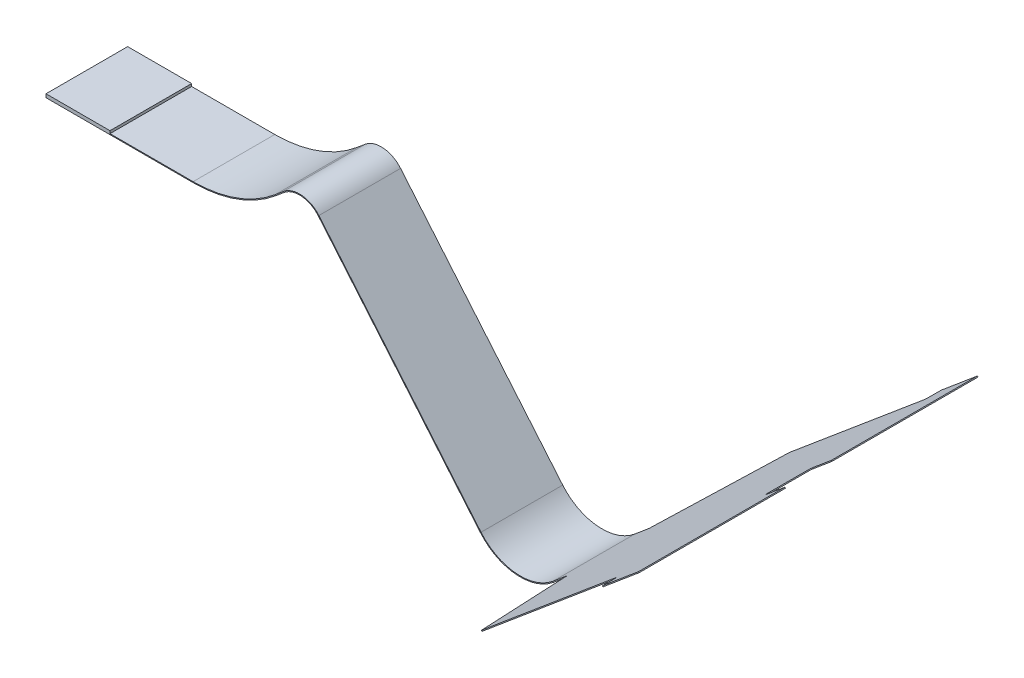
ISO-10303-21;
HEADER;
FILE_DESCRIPTION(('STEP AP214'),'2;1');
FILE_NAME('part.step','',(''),(''),'','','');
FILE_SCHEMA(('AUTOMOTIVE_DESIGN { 1 0 10303 214 1 1 1 1 }'));
ENDSEC;
DATA;
#1=APPLICATION_CONTEXT('core data for automotive mechanical design processes');
#2=APPLICATION_PROTOCOL_DEFINITION('international standard','automotive_design',2000,#1);
#3=PRODUCT_CONTEXT('',#1,'mechanical');
#4=PRODUCT('Part','Part','',(#3));
#5=PRODUCT_RELATED_PRODUCT_CATEGORY('part','',(#4));
#6=PRODUCT_DEFINITION_FORMATION('','',#4);
#7=PRODUCT_DEFINITION_CONTEXT('part definition',#1,'design');
#8=PRODUCT_DEFINITION('design','',#6,#7);
#9=PRODUCT_DEFINITION_SHAPE('','',#8);
#10=(LENGTH_UNIT() NAMED_UNIT(*) SI_UNIT(.MILLI.,.METRE.));
#11=(NAMED_UNIT(*) PLANE_ANGLE_UNIT() SI_UNIT($,.RADIAN.));
#12=(NAMED_UNIT(*) SI_UNIT($,.STERADIAN.) SOLID_ANGLE_UNIT());
#13=UNCERTAINTY_MEASURE_WITH_UNIT(LENGTH_MEASURE(1.E-05),#10,'distance_accuracy_value','');
#14=(GEOMETRIC_REPRESENTATION_CONTEXT(3) GLOBAL_UNCERTAINTY_ASSIGNED_CONTEXT((#13)) GLOBAL_UNIT_ASSIGNED_CONTEXT((#10,
#11,#12)) REPRESENTATION_CONTEXT('',''));
#15=CARTESIAN_POINT('',(0.,0.,0.));
#16=DIRECTION('',(0.,0.,1.));
#17=DIRECTION('',(1.,0.,0.));
#18=AXIS2_PLACEMENT_3D('',#15,#16,#17);
#19=CARTESIAN_POINT('',(214.602635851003,-51.510876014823,60.1965));
#20=DIRECTION('',(0.,0.,-1.));
#21=DIRECTION('',(-0.766044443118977,-0.642787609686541,0.));
#22=AXIS2_PLACEMENT_3D('',#19,#20,#21);
#23=PLANE('',#22);
#24=DIRECTION('',(-0.766044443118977,-0.642787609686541,0.));
#25=VECTOR('',#24,1.);
#26=CARTESIAN_POINT('',(214.377660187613,-51.2427604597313,60.1965));
#27=LINE('',#26,#25);
#28=CARTESIAN_POINT('',(266.851704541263,-7.21180919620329,60.1965));
#29=VERTEX_POINT('',#28);
#30=CARTESIAN_POINT('',(214.377660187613,-51.2427604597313,60.1965));
#31=VERTEX_POINT('',#30);
#32=EDGE_CURVE('E486',#29,#31,#27,.T.);
#33=ORIENTED_EDGE('',*,*,#32,.T.);
#34=DIRECTION('',(-0.642787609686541,0.766044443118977,0.));
#35=VECTOR('',#34,1.);
#36=CARTESIAN_POINT('',(214.602635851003,-51.510876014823,60.1965));
#37=LINE('',#36,#35);
#38=CARTESIAN_POINT('',(214.602635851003,-51.510876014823,60.1965));
#39=VERTEX_POINT('',#38);
#40=EDGE_CURVE('E571',#39,#31,#37,.T.);
#41=ORIENTED_EDGE('',*,*,#40,.F.);
#42=DIRECTION('',(-0.766044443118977,-0.642787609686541,0.));
#43=VECTOR('',#42,1.);
#44=CARTESIAN_POINT('',(214.602635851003,-51.510876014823,60.1965));
#45=LINE('',#44,#43);
#46=CARTESIAN_POINT('',(267.076680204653,-7.47992475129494,60.1965));
#47=VERTEX_POINT('',#46);
#48=EDGE_CURVE('E615',#47,#39,#45,.T.);
#49=ORIENTED_EDGE('',*,*,#48,.F.);
#50=DIRECTION('',(-0.642787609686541,0.766044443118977,0.));
#51=VECTOR('',#50,1.);
#52=CARTESIAN_POINT('',(267.076680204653,-7.47992475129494,60.1965));
#53=LINE('',#52,#51);
#54=EDGE_CURVE('E489',#47,#29,#53,.T.);
#55=ORIENTED_EDGE('',*,*,#54,.T.);
#56=EDGE_LOOP('',(#33,#41,#49,#55));
#57=FACE_BOUND('',#56,.T.);
#58=ADVANCED_FACE('F35',(#57),#23,.F.);
#59=CARTESIAN_POINT('',(267.076680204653,-7.47992475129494,61.1965));
#60=DIRECTION('',(-0.642787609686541,0.766044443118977,0.));
#61=DIRECTION('',(0.,0.,1.));
#62=AXIS2_PLACEMENT_3D('',#59,#60,#61);
#63=CYLINDRICAL_SURFACE('',#62,1.00000000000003);
#64=CARTESIAN_POINT('',(266.851704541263,-7.21180919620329,61.1965));
#65=DIRECTION('',(-0.642787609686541,0.766044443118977,0.));
#66=DIRECTION('',(0.,0.,-1.));
#67=AXIS2_PLACEMENT_3D('',#64,#65,#66);
#68=CIRCLE('',#67,1.00000000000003);
#69=CARTESIAN_POINT('',(267.617748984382,-6.56902158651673,61.1965));
#70=VERTEX_POINT('',#69);
#71=EDGE_CURVE('E494',#70,#29,#68,.T.);
#72=ORIENTED_EDGE('',*,*,#71,.T.);
#73=ORIENTED_EDGE('',*,*,#54,.F.);
#74=CARTESIAN_POINT('',(267.076680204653,-7.47992475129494,61.1965));
#75=DIRECTION('',(-0.642787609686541,0.766044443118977,0.));
#76=DIRECTION('',(0.,0.,-1.));
#77=AXIS2_PLACEMENT_3D('',#74,#75,#76);
#78=CIRCLE('',#77,1.00000000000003);
#79=CARTESIAN_POINT('',(267.842724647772,-6.83713714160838,61.1965));
#80=VERTEX_POINT('',#79);
#81=EDGE_CURVE('E612',#80,#47,#78,.T.);
#82=ORIENTED_EDGE('',*,*,#81,.F.);
#83=DIRECTION('',(-0.642787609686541,0.766044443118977,0.));
#84=VECTOR('',#83,1.);
#85=CARTESIAN_POINT('',(267.842724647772,-6.83713714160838,61.1965));
#86=LINE('',#85,#84);
#87=EDGE_CURVE('E497',#80,#70,#86,.T.);
#88=ORIENTED_EDGE('',*,*,#87,.T.);
#89=EDGE_LOOP('',(#72,#73,#82,#88));
#90=FACE_BOUND('',#89,.T.);
#91=ADVANCED_FACE('F710',(#90),#63,.F.);
#92=CARTESIAN_POINT('',(267.842724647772,-6.83713714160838,61.1965));
#93=DIRECTION('',(0.766044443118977,0.642787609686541,0.));
#94=DIRECTION('',(0.,0.,-1.));
#95=AXIS2_PLACEMENT_3D('',#92,#93,#94);
#96=PLANE('',#95);
#97=DIRECTION('',(0.,0.,-1.));
#98=VECTOR('',#97,1.);
#99=CARTESIAN_POINT('',(267.617748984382,-6.56902158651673,61.1965));
#100=LINE('',#99,#98);
#101=CARTESIAN_POINT('',(267.617748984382,-6.56902158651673,66.1964999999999));
#102=VERTEX_POINT('',#101);
#103=EDGE_CURVE('E499',#102,#70,#100,.T.);
#104=ORIENTED_EDGE('',*,*,#103,.T.);
#105=ORIENTED_EDGE('',*,*,#87,.F.);
#106=DIRECTION('',(0.,0.,-1.));
#107=VECTOR('',#106,1.);
#108=CARTESIAN_POINT('',(267.842724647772,-6.83713714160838,61.1965));
#109=LINE('',#108,#107);
#110=CARTESIAN_POINT('',(267.842724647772,-6.83713714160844,66.1965));
#111=VERTEX_POINT('',#110);
#112=EDGE_CURVE('E609',#111,#80,#109,.T.);
#113=ORIENTED_EDGE('',*,*,#112,.F.);
#114=DIRECTION('',(-0.642787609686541,0.766044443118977,0.));
#115=VECTOR('',#114,1.);
#116=CARTESIAN_POINT('',(267.842724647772,-6.83713714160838,66.1964999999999));
#117=LINE('',#116,#115);
#118=EDGE_CURVE('E502',#111,#102,#117,.T.);
#119=ORIENTED_EDGE('',*,*,#118,.T.);
#120=EDGE_LOOP('',(#104,#105,#113,#119));
#121=FACE_BOUND('',#120,.T.);
#122=ADVANCED_FACE('F716',(#121),#96,.F.);
#123=CARTESIAN_POINT('',(282.014546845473,5.05443363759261,66.1965));
#124=DIRECTION('',(0.,0.,-1.));
#125=DIRECTION('',(-0.766044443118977,-0.642787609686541,0.));
#126=AXIS2_PLACEMENT_3D('',#123,#124,#125);
#127=PLANE('',#126);
#128=DIRECTION('',(0.766044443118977,0.642787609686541,0.));
#129=VECTOR('',#128,1.);
#130=CARTESIAN_POINT('',(12.7424714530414,-220.434772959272,66.1965));
#131=LINE('',#130,#129);
#132=CARTESIAN_POINT('',(281.789571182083,5.32254919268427,66.1965));
#133=VERTEX_POINT('',#132);
#134=EDGE_CURVE('E54',#102,#133,#131,.T.);
#135=ORIENTED_EDGE('',*,*,#134,.F.);
#136=ORIENTED_EDGE('',*,*,#118,.F.);
#137=DIRECTION('',(0.766044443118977,0.642787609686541,0.));
#138=VECTOR('',#137,1.);
#139=CARTESIAN_POINT('',(12.9674471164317,-220.702888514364,66.1965));
#140=LINE('',#139,#138);
#141=CARTESIAN_POINT('',(282.014546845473,5.05443363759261,66.1965));
#142=VERTEX_POINT('',#141);
#143=EDGE_CURVE('E504',#111,#142,#140,.T.);
#144=ORIENTED_EDGE('',*,*,#143,.T.);
#145=DIRECTION('',(0.642787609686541,-0.766044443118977,0.));
#146=VECTOR('',#145,1.);
#147=CARTESIAN_POINT('',(281.789571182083,5.32254919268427,66.1965));
#148=LINE('',#147,#146);
#149=EDGE_CURVE('E509',#133,#142,#148,.T.);
#150=ORIENTED_EDGE('',*,*,#149,.F.);
#151=EDGE_LOOP('',(#135,#136,#144,#150));
#152=FACE_BOUND('',#151,.T.);
#153=ADVANCED_FACE('F725',(#152),#127,.F.);
#154=CARTESIAN_POINT('',(281.789571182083,5.32254919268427,66.1965));
#155=DIRECTION('',(0.766044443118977,0.642787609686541,0.));
#156=DIRECTION('',(0.,0.,-1.));
#157=AXIS2_PLACEMENT_3D('',#154,#155,#156);
#158=PLANE('',#157);
#159=DIRECTION('',(-0.642787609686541,0.766044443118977,0.));
#160=VECTOR('',#159,1.);
#161=CARTESIAN_POINT('',(282.014546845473,5.05443363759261,9.05349999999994));
#162=LINE('',#161,#160);
#163=CARTESIAN_POINT('',(282.014546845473,5.05443363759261,9.05349999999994));
#164=VERTEX_POINT('',#163);
#165=CARTESIAN_POINT('',(281.789571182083,5.32254919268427,9.05349999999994));
#166=VERTEX_POINT('',#165);
#167=EDGE_CURVE('E506',#164,#166,#162,.T.);
#168=ORIENTED_EDGE('',*,*,#167,.T.);
#169=DIRECTION('',(0.,0.,-1.));
#170=VECTOR('',#169,1.);
#171=CARTESIAN_POINT('',(281.789571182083,5.32254919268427,66.1965));
#172=LINE('',#171,#170);
#173=EDGE_CURVE('E45',#133,#166,#172,.T.);
#174=ORIENTED_EDGE('',*,*,#173,.F.);
#175=ORIENTED_EDGE('',*,*,#149,.T.);
#176=DIRECTION('',(0.,0.,-1.));
#177=VECTOR('',#176,1.);
#178=CARTESIAN_POINT('',(282.014546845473,5.05443363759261,66.1965));
#179=LINE('',#178,#177);
#180=EDGE_CURVE('E512',#142,#164,#179,.T.);
#181=ORIENTED_EDGE('',*,*,#180,.T.);
#182=EDGE_LOOP('',(#168,#174,#175,#181));
#183=FACE_BOUND('',#182,.T.);
#184=ADVANCED_FACE('F729',(#183),#158,.T.);
#185=CARTESIAN_POINT('',(282.014546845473,5.05443363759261,9.05349999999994));
#186=DIRECTION('',(0.,0.,1.));
#187=DIRECTION('',(0.766044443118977,0.642787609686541,0.));
#188=AXIS2_PLACEMENT_3D('',#185,#186,#187);
#189=PLANE('',#188);
#190=DIRECTION('',(0.766044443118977,0.642787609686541,0.));
#191=VECTOR('',#190,1.);
#192=CARTESIAN_POINT('',(281.789571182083,5.32254919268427,9.05349999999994));
#193=LINE('',#192,#191);
#194=CARTESIAN_POINT('',(274.512148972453,-0.783933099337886,9.05349999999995));
#195=VERTEX_POINT('',#194);
#196=EDGE_CURVE('E513',#195,#166,#193,.T.);
#197=ORIENTED_EDGE('',*,*,#196,.T.);
#198=ORIENTED_EDGE('',*,*,#167,.F.);
#199=DIRECTION('',(0.766044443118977,0.642787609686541,0.));
#200=VECTOR('',#199,1.);
#201=CARTESIAN_POINT('',(282.014546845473,5.05443363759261,9.05349999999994));
#202=LINE('',#201,#200);
#203=CARTESIAN_POINT('',(274.737124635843,-1.05204865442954,9.05349999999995));
#204=VERTEX_POINT('',#203);
#205=EDGE_CURVE('E606',#204,#164,#202,.T.);
#206=ORIENTED_EDGE('',*,*,#205,.F.);
#207=DIRECTION('',(-0.642787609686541,0.766044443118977,0.));
#208=VECTOR('',#207,1.);
#209=CARTESIAN_POINT('',(274.737124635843,-1.05204865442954,9.05349999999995));
#210=LINE('',#209,#208);
#211=EDGE_CURVE('E515',#204,#195,#210,.T.);
#212=ORIENTED_EDGE('',*,*,#211,.T.);
#213=EDGE_LOOP('',(#197,#198,#206,#212));
#214=FACE_BOUND('',#213,.T.);
#215=ADVANCED_FACE('F733',(#214),#189,.F.);
#216=CARTESIAN_POINT('',(274.737124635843,-1.05204865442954,8.05349999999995));
#217=DIRECTION('',(-0.642787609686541,0.766044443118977,0.));
#218=DIRECTION('',(0.,0.,1.));
#219=AXIS2_PLACEMENT_3D('',#216,#217,#218);
#220=CYLINDRICAL_SURFACE('',#219,1.);
#221=CARTESIAN_POINT('',(274.512148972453,-0.783933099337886,8.05349999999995));
#222=DIRECTION('',(-0.642787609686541,0.766044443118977,0.));
#223=DIRECTION('',(0.,0.,-1.));
#224=AXIS2_PLACEMENT_3D('',#221,#222,#223);
#225=CIRCLE('',#224,1.);
#226=CARTESIAN_POINT('',(273.746104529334,-1.42672070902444,8.05349999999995));
#227=VERTEX_POINT('',#226);
#228=EDGE_CURVE('E517',#227,#195,#225,.T.);
#229=ORIENTED_EDGE('',*,*,#228,.T.);
#230=ORIENTED_EDGE('',*,*,#211,.F.);
#231=CARTESIAN_POINT('',(274.737124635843,-1.05204865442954,8.05349999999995));
#232=DIRECTION('',(-0.642787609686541,0.766044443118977,0.));
#233=DIRECTION('',(0.,0.,-1.));
#234=AXIS2_PLACEMENT_3D('',#231,#232,#233);
#235=CIRCLE('',#234,1.);
#236=CARTESIAN_POINT('',(273.971080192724,-1.6948362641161,8.05349999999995));
#237=VERTEX_POINT('',#236);
#238=EDGE_CURVE('E603',#237,#204,#235,.T.);
#239=ORIENTED_EDGE('',*,*,#238,.F.);
#240=DIRECTION('',(-0.642787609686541,0.766044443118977,0.));
#241=VECTOR('',#240,1.);
#242=CARTESIAN_POINT('',(273.971080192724,-1.6948362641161,8.05349999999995));
#243=LINE('',#242,#241);
#244=EDGE_CURVE('E520',#237,#227,#243,.T.);
#245=ORIENTED_EDGE('',*,*,#244,.T.);
#246=EDGE_LOOP('',(#229,#230,#239,#245));
#247=FACE_BOUND('',#246,.T.);
#248=ADVANCED_FACE('F738',(#247),#220,.F.);
#249=CARTESIAN_POINT('',(273.971080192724,-1.6948362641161,-8.05350000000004));
#250=DIRECTION('',(-0.766044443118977,-0.642787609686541,0.));
#251=DIRECTION('',(0.,0.,1.));
#252=AXIS2_PLACEMENT_3D('',#249,#250,#251);
#253=PLANE('',#252);
#254=DIRECTION('',(0.,0.,1.));
#255=VECTOR('',#254,1.);
#256=CARTESIAN_POINT('',(273.746104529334,-1.42672070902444,-8.05350000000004));
#257=LINE('',#256,#255);
#258=CARTESIAN_POINT('',(273.746104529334,-1.42672070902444,-8.05350000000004));
#259=VERTEX_POINT('',#258);
#260=EDGE_CURVE('E522',#259,#227,#257,.T.);
#261=ORIENTED_EDGE('',*,*,#260,.T.);
#262=ORIENTED_EDGE('',*,*,#244,.F.);
#263=DIRECTION('',(0.,0.,1.));
#264=VECTOR('',#263,1.);
#265=CARTESIAN_POINT('',(273.971080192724,-1.6948362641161,-8.05350000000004));
#266=LINE('',#265,#264);
#267=CARTESIAN_POINT('',(273.971080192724,-1.6948362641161,-8.05350000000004));
#268=VERTEX_POINT('',#267);
#269=EDGE_CURVE('E600',#268,#237,#266,.T.);
#270=ORIENTED_EDGE('',*,*,#269,.F.);
#271=DIRECTION('',(-0.642787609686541,0.766044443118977,0.));
#272=VECTOR('',#271,1.);
#273=CARTESIAN_POINT('',(273.971080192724,-1.6948362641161,-8.05350000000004));
#274=LINE('',#273,#272);
#275=EDGE_CURVE('E525',#268,#259,#274,.T.);
#276=ORIENTED_EDGE('',*,*,#275,.T.);
#277=EDGE_LOOP('',(#261,#262,#270,#276));
#278=FACE_BOUND('',#277,.T.);
#279=ADVANCED_FACE('F742',(#278),#253,.F.);
#280=CARTESIAN_POINT('',(274.737124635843,-1.05204865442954,-8.05350000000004));
#281=DIRECTION('',(-0.642787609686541,0.766044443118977,0.));
#282=DIRECTION('',(0.,0.,1.));
#283=AXIS2_PLACEMENT_3D('',#280,#281,#282);
#284=CYLINDRICAL_SURFACE('',#283,1.);
#285=CARTESIAN_POINT('',(274.512148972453,-0.783933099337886,-8.05350000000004));
#286=DIRECTION('',(-0.642787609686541,0.766044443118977,0.));
#287=DIRECTION('',(0.,0.,-1.));
#288=AXIS2_PLACEMENT_3D('',#285,#286,#287);
#289=CIRCLE('',#288,1.);
#290=CARTESIAN_POINT('',(274.512148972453,-0.783933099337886,-9.05350000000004));
#291=VERTEX_POINT('',#290);
#292=EDGE_CURVE('E528',#291,#259,#289,.T.);
#293=ORIENTED_EDGE('',*,*,#292,.T.);
#294=ORIENTED_EDGE('',*,*,#275,.F.);
#295=CARTESIAN_POINT('',(274.737124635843,-1.05204865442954,-8.05350000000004));
#296=DIRECTION('',(-0.642787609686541,0.766044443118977,0.));
#297=DIRECTION('',(0.,0.,-1.));
#298=AXIS2_PLACEMENT_3D('',#295,#296,#297);
#299=CIRCLE('',#298,1.);
#300=CARTESIAN_POINT('',(274.737124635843,-1.05204865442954,-9.05350000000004));
#301=VERTEX_POINT('',#300);
#302=EDGE_CURVE('E597',#301,#268,#299,.T.);
#303=ORIENTED_EDGE('',*,*,#302,.F.);
#304=DIRECTION('',(-0.642787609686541,0.766044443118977,0.));
#305=VECTOR('',#304,1.);
#306=CARTESIAN_POINT('',(274.737124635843,-1.05204865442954,-9.05350000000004));
#307=LINE('',#306,#305);
#308=EDGE_CURVE('E530',#301,#291,#307,.T.);
#309=ORIENTED_EDGE('',*,*,#308,.T.);
#310=EDGE_LOOP('',(#293,#294,#303,#309));
#311=FACE_BOUND('',#310,.T.);
#312=ADVANCED_FACE('F746',(#311),#284,.F.);
#313=CARTESIAN_POINT('',(282.014546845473,5.05443363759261,-9.05350000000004));
#314=DIRECTION('',(0.,0.,-1.));
#315=DIRECTION('',(-0.766044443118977,-0.642787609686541,0.));
#316=AXIS2_PLACEMENT_3D('',#313,#314,#315);
#317=PLANE('',#316);
#318=DIRECTION('',(-0.766044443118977,-0.642787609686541,0.));
#319=VECTOR('',#318,1.);
#320=CARTESIAN_POINT('',(281.789571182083,5.32254919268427,-9.05350000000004));
#321=LINE('',#320,#319);
#322=CARTESIAN_POINT('',(281.789571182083,5.32254919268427,-9.05350000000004));
#323=VERTEX_POINT('',#322);
#324=EDGE_CURVE('E532',#323,#291,#321,.T.);
#325=ORIENTED_EDGE('',*,*,#324,.T.);
#326=ORIENTED_EDGE('',*,*,#308,.F.);
#327=DIRECTION('',(-0.766044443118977,-0.642787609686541,0.));
#328=VECTOR('',#327,1.);
#329=CARTESIAN_POINT('',(282.014546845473,5.05443363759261,-9.05350000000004));
#330=LINE('',#329,#328);
#331=CARTESIAN_POINT('',(282.014546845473,5.05443363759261,-9.05350000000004));
#332=VERTEX_POINT('',#331);
#333=EDGE_CURVE('E594',#332,#301,#330,.T.);
#334=ORIENTED_EDGE('',*,*,#333,.F.);
#335=DIRECTION('',(-0.642787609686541,0.766044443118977,0.));
#336=VECTOR('',#335,1.);
#337=CARTESIAN_POINT('',(282.014546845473,5.05443363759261,-9.05350000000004));
#338=LINE('',#337,#336);
#339=EDGE_CURVE('E535',#332,#323,#338,.T.);
#340=ORIENTED_EDGE('',*,*,#339,.T.);
#341=EDGE_LOOP('',(#325,#326,#334,#340));
#342=FACE_BOUND('',#341,.T.);
#343=ADVANCED_FACE('F750',(#342),#317,.F.);
#344=ORIENTED_EDGE('',*,*,#339,.F.);
#345=CARTESIAN_POINT('',(282.014546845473,5.05443363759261,-66.1965));
#346=VERTEX_POINT('',#345);
#347=EDGE_CURVE('E537',#332,#346,#179,.T.);
#348=ORIENTED_EDGE('',*,*,#347,.T.);
#349=DIRECTION('',(0.642787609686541,-0.766044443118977,0.));
#350=VECTOR('',#349,1.);
#351=CARTESIAN_POINT('',(281.789571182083,5.32254919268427,-66.1965));
#352=LINE('',#351,#350);
#353=CARTESIAN_POINT('',(281.789571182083,5.32254919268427,-66.1965));
#354=VERTEX_POINT('',#353);
#355=EDGE_CURVE('E545',#354,#346,#352,.T.);
#356=ORIENTED_EDGE('',*,*,#355,.F.);
#357=EDGE_CURVE('E11',#323,#354,#172,.T.);
#358=ORIENTED_EDGE('',*,*,#357,.F.);
#359=EDGE_LOOP('',(#344,#348,#356,#358));
#360=FACE_BOUND('',#359,.T.);
#361=ADVANCED_FACE('F735',(#360),#158,.T.);
#362=CARTESIAN_POINT('',(282.014546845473,5.05443363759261,-66.1965));
#363=DIRECTION('',(0.,0.,-1.));
#364=DIRECTION('',(-0.766044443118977,-0.642787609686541,0.));
#365=AXIS2_PLACEMENT_3D('',#362,#363,#364);
#366=PLANE('',#365);
#367=DIRECTION('',(-0.642787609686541,0.766044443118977,0.));
#368=VECTOR('',#367,1.);
#369=CARTESIAN_POINT('',(267.842724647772,-6.83713714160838,-66.1965));
#370=LINE('',#369,#368);
#371=CARTESIAN_POINT('',(267.842724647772,-6.83713714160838,-66.1965));
#372=VERTEX_POINT('',#371);
#373=CARTESIAN_POINT('',(267.617748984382,-6.56902158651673,-66.1965));
#374=VERTEX_POINT('',#373);
#375=EDGE_CURVE('E540',#372,#374,#370,.T.);
#376=ORIENTED_EDGE('',*,*,#375,.T.);
#377=DIRECTION('',(0.766044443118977,0.642787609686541,0.));
#378=VECTOR('',#377,1.);
#379=CARTESIAN_POINT('',(12.7424714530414,-220.434772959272,-66.1965));
#380=LINE('',#379,#378);
#381=EDGE_CURVE('E543',#374,#354,#380,.T.);
#382=ORIENTED_EDGE('',*,*,#381,.T.);
#383=ORIENTED_EDGE('',*,*,#355,.T.);
#384=DIRECTION('',(0.766044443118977,0.642787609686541,0.));
#385=VECTOR('',#384,1.);
#386=CARTESIAN_POINT('',(12.9674471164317,-220.702888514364,-66.1965));
#387=LINE('',#386,#385);
#388=EDGE_CURVE('E592',#372,#346,#387,.T.);
#389=ORIENTED_EDGE('',*,*,#388,.F.);
#390=EDGE_LOOP('',(#376,#382,#383,#389));
#391=FACE_BOUND('',#390,.T.);
#392=ADVANCED_FACE('F755',(#391),#366,.T.);
#393=CARTESIAN_POINT('',(267.842724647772,-6.83713714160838,-66.1965));
#394=DIRECTION('',(0.766044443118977,0.642787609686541,0.));
#395=DIRECTION('',(0.,0.,-1.));
#396=AXIS2_PLACEMENT_3D('',#393,#394,#395);
#397=PLANE('',#396);
#398=DIRECTION('',(0.,0.,-1.));
#399=VECTOR('',#398,1.);
#400=CARTESIAN_POINT('',(267.617748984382,-6.56902158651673,-66.1965));
#401=LINE('',#400,#399);
#402=CARTESIAN_POINT('',(267.617748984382,-6.56902158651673,-61.1965));
#403=VERTEX_POINT('',#402);
#404=EDGE_CURVE('E548',#403,#374,#401,.T.);
#405=ORIENTED_EDGE('',*,*,#404,.T.);
#406=ORIENTED_EDGE('',*,*,#375,.F.);
#407=DIRECTION('',(0.,0.,-1.));
#408=VECTOR('',#407,1.);
#409=CARTESIAN_POINT('',(267.842724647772,-6.83713714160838,-66.1965));
#410=LINE('',#409,#408);
#411=CARTESIAN_POINT('',(267.842724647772,-6.83713714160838,-61.1965));
#412=VERTEX_POINT('',#411);
#413=EDGE_CURVE('E589',#412,#372,#410,.T.);
#414=ORIENTED_EDGE('',*,*,#413,.F.);
#415=DIRECTION('',(-0.642787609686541,0.766044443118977,0.));
#416=VECTOR('',#415,1.);
#417=CARTESIAN_POINT('',(267.842724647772,-6.83713714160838,-61.1965));
#418=LINE('',#417,#416);
#419=EDGE_CURVE('E550',#412,#403,#418,.T.);
#420=ORIENTED_EDGE('',*,*,#419,.T.);
#421=EDGE_LOOP('',(#405,#406,#414,#420));
#422=FACE_BOUND('',#421,.T.);
#423=ADVANCED_FACE('F758',(#422),#397,.F.);
#424=CARTESIAN_POINT('',(267.076680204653,-7.47992475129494,-61.1965));
#425=DIRECTION('',(-0.642787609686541,0.766044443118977,0.));
#426=DIRECTION('',(0.,0.,1.));
#427=AXIS2_PLACEMENT_3D('',#424,#425,#426);
#428=CYLINDRICAL_SURFACE('',#427,1.00000000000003);
#429=CARTESIAN_POINT('',(266.851704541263,-7.21180919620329,-61.1965));
#430=DIRECTION('',(-0.642787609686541,0.766044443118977,0.));
#431=DIRECTION('',(0.,0.,-1.));
#432=AXIS2_PLACEMENT_3D('',#429,#430,#431);
#433=CIRCLE('',#432,1.00000000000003);
#434=CARTESIAN_POINT('',(266.851704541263,-7.21180919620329,-60.1965));
#435=VERTEX_POINT('',#434);
#436=EDGE_CURVE('E552',#435,#403,#433,.T.);
#437=ORIENTED_EDGE('',*,*,#436,.T.);
#438=ORIENTED_EDGE('',*,*,#419,.F.);
#439=CARTESIAN_POINT('',(267.076680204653,-7.47992475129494,-61.1965));
#440=DIRECTION('',(-0.642787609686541,0.766044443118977,0.));
#441=DIRECTION('',(0.,0.,-1.));
#442=AXIS2_PLACEMENT_3D('',#439,#440,#441);
#443=CIRCLE('',#442,1.00000000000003);
#444=CARTESIAN_POINT('',(267.076680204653,-7.47992475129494,-60.1965));
#445=VERTEX_POINT('',#444);
#446=EDGE_CURVE('E586',#445,#412,#443,.T.);
#447=ORIENTED_EDGE('',*,*,#446,.F.);
#448=DIRECTION('',(-0.642787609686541,0.766044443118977,0.));
#449=VECTOR('',#448,1.);
#450=CARTESIAN_POINT('',(267.076680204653,-7.47992475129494,-60.1965));
#451=LINE('',#450,#449);
#452=EDGE_CURVE('E555',#445,#435,#451,.T.);
#453=ORIENTED_EDGE('',*,*,#452,.T.);
#454=EDGE_LOOP('',(#437,#438,#447,#453));
#455=FACE_BOUND('',#454,.T.);
#456=ADVANCED_FACE('F762',(#455),#428,.F.);
#457=CARTESIAN_POINT('',(214.602635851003,-51.510876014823,-60.1965));
#458=DIRECTION('',(0.,0.,1.));
#459=DIRECTION('',(0.766044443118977,0.642787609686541,0.));
#460=AXIS2_PLACEMENT_3D('',#457,#458,#459);
#461=PLANE('',#460);
#462=DIRECTION('',(0.766044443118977,0.642787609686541,0.));
#463=VECTOR('',#462,1.);
#464=CARTESIAN_POINT('',(214.377660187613,-51.2427604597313,-60.1965));
#465=LINE('',#464,#463);
#466=CARTESIAN_POINT('',(214.377660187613,-51.2427604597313,-60.1965));
#467=VERTEX_POINT('',#466);
#468=EDGE_CURVE('E557',#467,#435,#465,.T.);
#469=ORIENTED_EDGE('',*,*,#468,.T.);
#470=ORIENTED_EDGE('',*,*,#452,.F.);
#471=DIRECTION('',(0.766044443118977,0.642787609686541,0.));
#472=VECTOR('',#471,1.);
#473=CARTESIAN_POINT('',(214.602635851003,-51.510876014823,-60.1965));
#474=LINE('',#473,#472);
#475=CARTESIAN_POINT('',(214.602635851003,-51.510876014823,-60.1965));
#476=VERTEX_POINT('',#475);
#477=EDGE_CURVE('E583',#476,#445,#474,.T.);
#478=ORIENTED_EDGE('',*,*,#477,.F.);
#479=DIRECTION('',(-0.642787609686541,0.766044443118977,0.));
#480=VECTOR('',#479,1.);
#481=CARTESIAN_POINT('',(214.602635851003,-51.510876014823,-60.1965));
#482=LINE('',#481,#480);
#483=EDGE_CURVE('E560',#476,#467,#482,.T.);
#484=ORIENTED_EDGE('',*,*,#483,.T.);
#485=EDGE_LOOP('',(#469,#470,#478,#484));
#486=FACE_BOUND('',#485,.T.);
#487=ADVANCED_FACE('F766',(#486),#461,.F.);
#488=CARTESIAN_POINT('',(214.602635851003,-51.510876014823,-60.1965));
#489=DIRECTION('',(0.730350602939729,0.612836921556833,0.301693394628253));
#490=DIRECTION('',(0.231110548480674,0.193924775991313,-0.953405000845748));
#491=AXIS2_PLACEMENT_3D('',#488,#489,#490);
#492=PLANE('',#491);
#493=DIRECTION('',(0.231110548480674,0.193924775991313,-0.953405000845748));
#494=VECTOR('',#493,1.);
#495=CARTESIAN_POINT('',(214.377660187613,-51.2427604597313,-60.1965));
#496=LINE('',#495,#494);
#497=CARTESIAN_POINT('',(203.653037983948,-60.2417869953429,-15.954));
#498=VERTEX_POINT('',#497);
#499=EDGE_CURVE('E562',#498,#467,#496,.T.);
#500=ORIENTED_EDGE('',*,*,#499,.T.);
#501=ORIENTED_EDGE('',*,*,#483,.F.);
#502=DIRECTION('',(0.231110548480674,0.193924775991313,-0.953405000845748));
#503=VECTOR('',#502,1.);
#504=CARTESIAN_POINT('',(214.602635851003,-51.510876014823,-60.1965));
#505=LINE('',#504,#503);
#506=CARTESIAN_POINT('',(203.878013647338,-60.5099025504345,-15.954));
#507=VERTEX_POINT('',#506);
#508=EDGE_CURVE('E580',#507,#476,#505,.T.);
#509=ORIENTED_EDGE('',*,*,#508,.F.);
#510=DIRECTION('',(-0.642787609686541,0.766044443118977,0.));
#511=VECTOR('',#510,1.);
#512=CARTESIAN_POINT('',(203.878013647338,-60.5099025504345,-15.954));
#513=LINE('',#512,#511);
#514=EDGE_CURVE('E565',#507,#498,#513,.T.);
#515=ORIENTED_EDGE('',*,*,#514,.T.);
#516=EDGE_LOOP('',(#500,#501,#509,#515));
#517=FACE_BOUND('',#516,.T.);
#518=ADVANCED_FACE('F770',(#517),#492,.F.);
#519=CARTESIAN_POINT('',(214.602635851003,-51.510876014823,60.1965));
#520=DIRECTION('',(0.730350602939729,0.612836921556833,-0.301693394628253));
#521=DIRECTION('',(-0.231110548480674,-0.193924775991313,-0.953405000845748));
#522=AXIS2_PLACEMENT_3D('',#519,#520,#521);
#523=PLANE('',#522);
#524=DIRECTION('',(-0.231110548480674,-0.193924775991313,-0.953405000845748));
#525=VECTOR('',#524,1.);
#526=CARTESIAN_POINT('',(214.377660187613,-51.2427604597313,60.1965));
#527=LINE('',#526,#525);
#528=CARTESIAN_POINT('',(203.653037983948,-60.2417869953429,15.954));
#529=VERTEX_POINT('',#528);
#530=EDGE_CURVE('E568',#31,#529,#527,.T.);
#531=ORIENTED_EDGE('',*,*,#530,.T.);
#532=DIRECTION('',(-0.642787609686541,0.766044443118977,0.));
#533=VECTOR('',#532,1.);
#534=CARTESIAN_POINT('',(203.878013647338,-60.5099025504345,15.954));
#535=LINE('',#534,#533);
#536=CARTESIAN_POINT('',(203.878013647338,-60.5099025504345,15.954));
#537=VERTEX_POINT('',#536);
#538=EDGE_CURVE('E573',#537,#529,#535,.T.);
#539=ORIENTED_EDGE('',*,*,#538,.F.);
#540=DIRECTION('',(-0.231110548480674,-0.193924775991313,-0.953405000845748));
#541=VECTOR('',#540,1.);
#542=CARTESIAN_POINT('',(214.602635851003,-51.510876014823,60.1965));
#543=LINE('',#542,#541);
#544=EDGE_CURVE('E460',#39,#537,#543,.T.);
#545=ORIENTED_EDGE('',*,*,#544,.F.);
#546=ORIENTED_EDGE('',*,*,#40,.T.);
#547=EDGE_LOOP('',(#531,#539,#545,#546));
#548=FACE_BOUND('',#547,.T.);
#549=ADVANCED_FACE('F774',(#548),#523,.F.);
#550=CARTESIAN_POINT('',(12.9674471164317,-220.702888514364,15.954));
#551=DIRECTION('',(0.,0.,-1.));
#552=DIRECTION('',(-0.766044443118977,-0.642787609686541,0.));
#553=AXIS2_PLACEMENT_3D('',#550,#551,#552);
#554=PLANE('',#553);
#555=DIRECTION('',(-0.642787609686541,0.766044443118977,0.));
#556=VECTOR('',#555,1.);
#557=CARTESIAN_POINT('',(198.384891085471,-65.1191796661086,15.954));
#558=LINE('',#557,#556);
#559=CARTESIAN_POINT('',(198.384891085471,-65.1191796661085,15.954));
#560=VERTEX_POINT('',#559);
#561=CARTESIAN_POINT('',(198.159915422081,-64.8510641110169,15.954));
#562=VERTEX_POINT('',#561);
#563=EDGE_CURVE('E39',#560,#562,#558,.T.);
#564=ORIENTED_EDGE('',*,*,#563,.F.);
#565=DIRECTION('',(-0.766044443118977,-0.642787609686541,0.));
#566=VECTOR('',#565,1.);
#567=CARTESIAN_POINT('',(12.9674471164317,-220.702888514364,15.954));
#568=LINE('',#567,#566);
#569=EDGE_CURVE('E455',#537,#560,#568,.T.);
#570=ORIENTED_EDGE('',*,*,#569,.F.);
#571=ORIENTED_EDGE('',*,*,#538,.T.);
#572=DIRECTION('',(-0.766044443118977,-0.642787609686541,0.));
#573=VECTOR('',#572,1.);
#574=CARTESIAN_POINT('',(12.7424714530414,-220.434772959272,15.954));
#575=LINE('',#574,#573);
#576=EDGE_CURVE('E467',#529,#562,#575,.T.);
#577=ORIENTED_EDGE('',*,*,#576,.T.);
#578=EDGE_LOOP('',(#564,#570,#571,#577));
#579=FACE_BOUND('',#578,.T.);
#580=ADVANCED_FACE('F466',(#579),#554,.F.);
#581=CARTESIAN_POINT('',(12.9674471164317,-220.702888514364,66.1965));
#582=DIRECTION('',(-0.642787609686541,0.766044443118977,0.));
#583=DIRECTION('',(0.,0.,1.));
#584=AXIS2_PLACEMENT_3D('',#581,#582,#583);
#585=PLANE('',#584);
#586=DIRECTION('',(0.,0.,1.));
#587=VECTOR('',#586,1.);
#588=CARTESIAN_POINT('',(198.384891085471,-65.1191796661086,66.1965));
#589=LINE('',#588,#587);
#590=CARTESIAN_POINT('',(198.384891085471,-65.1191796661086,-15.954));
#591=VERTEX_POINT('',#590);
#592=EDGE_CURVE('E171',#591,#560,#589,.T.);
#593=ORIENTED_EDGE('',*,*,#592,.F.);
#594=DIRECTION('',(0.766044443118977,0.642787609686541,0.));
#595=VECTOR('',#594,1.);
#596=CARTESIAN_POINT('',(12.9674471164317,-220.702888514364,-15.954));
#597=LINE('',#596,#595);
#598=EDGE_CURVE('E578',#591,#507,#597,.T.);
#599=ORIENTED_EDGE('',*,*,#598,.T.);
#600=ORIENTED_EDGE('',*,*,#508,.T.);
#601=ORIENTED_EDGE('',*,*,#477,.T.);
#602=ORIENTED_EDGE('',*,*,#446,.T.);
#603=ORIENTED_EDGE('',*,*,#413,.T.);
#604=ORIENTED_EDGE('',*,*,#388,.T.);
#605=ORIENTED_EDGE('',*,*,#347,.F.);
#606=ORIENTED_EDGE('',*,*,#333,.T.);
#607=ORIENTED_EDGE('',*,*,#302,.T.);
#608=ORIENTED_EDGE('',*,*,#269,.T.);
#609=ORIENTED_EDGE('',*,*,#238,.T.);
#610=ORIENTED_EDGE('',*,*,#205,.T.);
#611=ORIENTED_EDGE('',*,*,#180,.F.);
#612=ORIENTED_EDGE('',*,*,#143,.F.);
#613=ORIENTED_EDGE('',*,*,#112,.T.);
#614=ORIENTED_EDGE('',*,*,#81,.T.);
#615=ORIENTED_EDGE('',*,*,#48,.T.);
#616=ORIENTED_EDGE('',*,*,#544,.T.);
#617=ORIENTED_EDGE('',*,*,#569,.T.);
#618=EDGE_LOOP('',(#593,#599,#600,#601,#602,#603,#604,#605,#606,#607,#608,#609,#610,#611,#612,
#613,#614,#615,#616,#617));
#619=FACE_BOUND('',#618,.T.);
#620=ADVANCED_FACE('F457',(#619),#585,.F.);
#621=CARTESIAN_POINT('',(12.9674471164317,-220.702888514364,-15.954));
#622=DIRECTION('',(0.,0.,1.));
#623=DIRECTION('',(0.766044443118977,0.642787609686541,0.));
#624=AXIS2_PLACEMENT_3D('',#621,#622,#623);
#625=PLANE('',#624);
#626=DIRECTION('',(0.642787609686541,-0.766044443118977,0.));
#627=VECTOR('',#626,1.);
#628=CARTESIAN_POINT('',(198.384891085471,-65.1191796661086,-15.954));
#629=LINE('',#628,#627);
#630=CARTESIAN_POINT('',(198.159915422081,-64.8510641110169,-15.954));
#631=VERTEX_POINT('',#630);
#632=EDGE_CURVE('E471',#631,#591,#629,.T.);
#633=ORIENTED_EDGE('',*,*,#632,.F.);
#634=DIRECTION('',(0.766044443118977,0.642787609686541,0.));
#635=VECTOR('',#634,1.);
#636=CARTESIAN_POINT('',(12.7424714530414,-220.434772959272,-15.954));
#637=LINE('',#636,#635);
#638=EDGE_CURVE('E462',#631,#498,#637,.T.);
#639=ORIENTED_EDGE('',*,*,#638,.T.);
#640=ORIENTED_EDGE('',*,*,#514,.F.);
#641=ORIENTED_EDGE('',*,*,#598,.F.);
#642=EDGE_LOOP('',(#633,#639,#640,#641));
#643=FACE_BOUND('',#642,.T.);
#644=ADVANCED_FACE('F707',(#643),#625,.F.);
#645=CARTESIAN_POINT('',(12.7424714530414,-220.434772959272,66.1965));
#646=DIRECTION('',(-0.642787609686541,0.766044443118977,0.));
#647=DIRECTION('',(0.,0.,1.));
#648=AXIS2_PLACEMENT_3D('',#645,#646,#647);
#649=PLANE('',#648);
#650=ORIENTED_EDGE('',*,*,#638,.F.);
#651=DIRECTION('',(0.,0.,1.));
#652=VECTOR('',#651,1.);
#653=CARTESIAN_POINT('',(198.159915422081,-64.8510641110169,66.1965));
#654=LINE('',#653,#652);
#655=EDGE_CURVE('E178',#631,#562,#654,.T.);
#656=ORIENTED_EDGE('',*,*,#655,.T.);
#657=ORIENTED_EDGE('',*,*,#576,.F.);
#658=ORIENTED_EDGE('',*,*,#530,.F.);
#659=ORIENTED_EDGE('',*,*,#32,.F.);
#660=ORIENTED_EDGE('',*,*,#71,.F.);
#661=ORIENTED_EDGE('',*,*,#103,.F.);
#662=ORIENTED_EDGE('',*,*,#134,.T.);
#663=ORIENTED_EDGE('',*,*,#173,.T.);
#664=ORIENTED_EDGE('',*,*,#196,.F.);
#665=ORIENTED_EDGE('',*,*,#228,.F.);
#666=ORIENTED_EDGE('',*,*,#260,.F.);
#667=ORIENTED_EDGE('',*,*,#292,.F.);
#668=ORIENTED_EDGE('',*,*,#324,.F.);
#669=ORIENTED_EDGE('',*,*,#357,.T.);
#670=ORIENTED_EDGE('',*,*,#381,.F.);
#671=ORIENTED_EDGE('',*,*,#404,.F.);
#672=ORIENTED_EDGE('',*,*,#436,.F.);
#673=ORIENTED_EDGE('',*,*,#468,.F.);
#674=ORIENTED_EDGE('',*,*,#499,.F.);
#675=EDGE_LOOP('',(#650,#656,#657,#658,#659,#660,#661,#662,#663,#664,#665,#666,#667,#668,#669,
#670,#671,#672,#673,#674));
#676=FACE_BOUND('',#675,.T.);
#677=ADVANCED_FACE('F37',(#676),#649,.T.);
#678=CARTESIAN_POINT('',(111.709088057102,2.47315815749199,6.046));
#679=DIRECTION('',(0.766044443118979,0.642787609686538,0.));
#680=DIRECTION('',(0.,0.,1.));
#681=AXIS2_PLACEMENT_3D('',#678,#679,#680);
#682=PLANE('',#681);
#683=DIRECTION('',(0.,0.,1.));
#684=VECTOR('',#683,1.);
#685=CARTESIAN_POINT('',(111.709088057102,2.47315815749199,-13.954));
#686=LINE('',#685,#684);
#687=CARTESIAN_POINT('',(111.709088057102,2.47315815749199,-13.954));
#688=VERTEX_POINT('',#687);
#689=CARTESIAN_POINT('',(111.709088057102,2.47315815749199,6.046));
#690=VERTEX_POINT('',#689);
#691=EDGE_CURVE('E647',#688,#690,#686,.T.);
#692=ORIENTED_EDGE('',*,*,#691,.F.);
#693=DIRECTION('',(-0.642787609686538,0.766044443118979,0.));
#694=VECTOR('',#693,1.);
#695=CARTESIAN_POINT('',(111.709088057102,2.47315815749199,-13.954));
#696=LINE('',#695,#694);
#697=CARTESIAN_POINT('',(118.136964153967,-5.1872862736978,-13.954));
#698=VERTEX_POINT('',#697);
#699=EDGE_CURVE('E642',#698,#688,#696,.T.);
#700=ORIENTED_EDGE('',*,*,#699,.F.);
#701=DIRECTION('',(0.,0.,-1.));
#702=VECTOR('',#701,1.);
#703=CARTESIAN_POINT('',(118.136964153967,-5.1872862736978,-13.954));
#704=LINE('',#703,#702);
#705=CARTESIAN_POINT('',(118.136964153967,-5.1872862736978,6.046));
#706=VERTEX_POINT('',#705);
#707=EDGE_CURVE('E658',#706,#698,#704,.T.);
#708=ORIENTED_EDGE('',*,*,#707,.F.);
#709=DIRECTION('',(0.642787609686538,-0.766044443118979,0.));
#710=VECTOR('',#709,1.);
#711=CARTESIAN_POINT('',(111.709088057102,2.47315815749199,6.046));
#712=LINE('',#711,#710);
#713=EDGE_CURVE('E653',#690,#706,#712,.T.);
#714=ORIENTED_EDGE('',*,*,#713,.F.);
#715=EDGE_LOOP('',(#692,#700,#708,#714));
#716=FACE_BOUND('',#715,.T.);
#717=ADVANCED_FACE('F699',(#716),#682,.F.);
#718=CARTESIAN_POINT('',(118.136964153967,-5.1872862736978,-13.954));
#719=DIRECTION('',(0.642787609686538,-0.766044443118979,0.));
#720=DIRECTION('',(0.,0.,-1.));
#721=AXIS2_PLACEMENT_3D('',#718,#719,#720);
#722=PLANE('',#721);
#723=DIRECTION('',(0.,0.,-1.));
#724=VECTOR('',#723,1.);
#725=CARTESIAN_POINT('',(120.128679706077,-3.5160384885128,-13.954));
#726=LINE('',#725,#724);
#727=CARTESIAN_POINT('',(120.128679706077,-3.5160384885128,6.046));
#728=VERTEX_POINT('',#727);
#729=CARTESIAN_POINT('',(120.128679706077,-3.5160384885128,-13.954));
#730=VERTEX_POINT('',#729);
#731=EDGE_CURVE('E670',#728,#730,#726,.T.);
#732=ORIENTED_EDGE('',*,*,#731,.F.);
#733=DIRECTION('',(0.766044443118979,0.642787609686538,0.));
#734=VECTOR('',#733,1.);
#735=CARTESIAN_POINT('',(118.136964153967,-5.1872862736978,6.046));
#736=LINE('',#735,#734);
#737=EDGE_CURVE('E650',#706,#728,#736,.T.);
#738=ORIENTED_EDGE('',*,*,#737,.F.);
#739=ORIENTED_EDGE('',*,*,#707,.T.);
#740=DIRECTION('',(0.766044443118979,0.642787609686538,0.));
#741=VECTOR('',#740,1.);
#742=CARTESIAN_POINT('',(118.136964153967,-5.1872862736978,-13.954));
#743=LINE('',#742,#741);
#744=EDGE_CURVE('E656',#698,#730,#743,.T.);
#745=ORIENTED_EDGE('',*,*,#744,.T.);
#746=EDGE_LOOP('',(#732,#738,#739,#745));
#747=FACE_BOUND('',#746,.T.);
#748=ADVANCED_FACE('F697',(#747),#722,.T.);
#749=CARTESIAN_POINT('',(111.709088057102,2.47315815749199,6.046));
#750=DIRECTION('',(0.,0.,1.));
#751=DIRECTION('',(0.642787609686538,-0.766044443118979,0.));
#752=AXIS2_PLACEMENT_3D('',#749,#750,#751);
#753=PLANE('',#752);
#754=DIRECTION('',(0.642787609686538,-0.766044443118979,0.));
#755=VECTOR('',#754,1.);
#756=CARTESIAN_POINT('',(113.700803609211,4.14440594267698,6.046));
#757=LINE('',#756,#755);
#758=CARTESIAN_POINT('',(113.700803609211,4.14440594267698,6.046));
#759=VERTEX_POINT('',#758);
#760=EDGE_CURVE('E673',#759,#728,#757,.T.);
#761=ORIENTED_EDGE('',*,*,#760,.F.);
#762=DIRECTION('',(0.766044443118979,0.642787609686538,0.));
#763=VECTOR('',#762,1.);
#764=CARTESIAN_POINT('',(111.709088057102,2.47315815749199,6.046));
#765=LINE('',#764,#763);
#766=EDGE_CURVE('E645',#690,#759,#765,.T.);
#767=ORIENTED_EDGE('',*,*,#766,.F.);
#768=ORIENTED_EDGE('',*,*,#713,.T.);
#769=ORIENTED_EDGE('',*,*,#737,.T.);
#770=EDGE_LOOP('',(#761,#767,#768,#769));
#771=FACE_BOUND('',#770,.T.);
#772=ADVANCED_FACE('F694',(#771),#753,.T.);
#773=CARTESIAN_POINT('',(111.709088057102,2.47315815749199,-13.954));
#774=DIRECTION('',(-0.642787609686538,0.766044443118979,0.));
#775=DIRECTION('',(0.,0.,1.));
#776=AXIS2_PLACEMENT_3D('',#773,#774,#775);
#777=PLANE('',#776);
#778=DIRECTION('',(0.,0.,1.));
#779=VECTOR('',#778,1.);
#780=CARTESIAN_POINT('',(113.700803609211,4.14440594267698,-13.954));
#781=LINE('',#780,#779);
#782=CARTESIAN_POINT('',(113.700803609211,4.14440594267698,-13.954));
#783=VERTEX_POINT('',#782);
#784=EDGE_CURVE('E678',#783,#759,#781,.T.);
#785=ORIENTED_EDGE('',*,*,#784,.F.);
#786=DIRECTION('',(0.766044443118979,0.642787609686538,0.));
#787=VECTOR('',#786,1.);
#788=CARTESIAN_POINT('',(111.709088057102,2.47315815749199,-13.954));
#789=LINE('',#788,#787);
#790=EDGE_CURVE('E640',#688,#783,#789,.T.);
#791=ORIENTED_EDGE('',*,*,#790,.F.);
#792=ORIENTED_EDGE('',*,*,#691,.T.);
#793=ORIENTED_EDGE('',*,*,#766,.T.);
#794=EDGE_LOOP('',(#785,#791,#792,#793));
#795=FACE_BOUND('',#794,.T.);
#796=ADVANCED_FACE('F690',(#795),#777,.T.);
#797=CARTESIAN_POINT('',(111.709088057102,2.47315815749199,-13.954));
#798=DIRECTION('',(0.,0.,-1.));
#799=DIRECTION('',(-0.642787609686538,0.766044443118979,0.));
#800=AXIS2_PLACEMENT_3D('',#797,#798,#799);
#801=PLANE('',#800);
#802=DIRECTION('',(-0.642787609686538,0.766044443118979,0.));
#803=VECTOR('',#802,1.);
#804=CARTESIAN_POINT('',(113.700803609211,4.14440594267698,-13.954));
#805=LINE('',#804,#803);
#806=EDGE_CURVE('E632',#730,#783,#805,.T.);
#807=ORIENTED_EDGE('',*,*,#806,.F.);
#808=ORIENTED_EDGE('',*,*,#744,.F.);
#809=ORIENTED_EDGE('',*,*,#699,.T.);
#810=ORIENTED_EDGE('',*,*,#790,.T.);
#811=EDGE_LOOP('',(#807,#808,#809,#810));
#812=FACE_BOUND('',#811,.T.);
#813=ADVANCED_FACE('F686',(#812),#801,.T.);
#814=CARTESIAN_POINT('',(34.7700293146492,98.7549431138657,66.1965));
#815=DIRECTION('',(0.766044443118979,0.642787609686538,0.));
#816=DIRECTION('',(0.,0.,1.));
#817=AXIS2_PLACEMENT_3D('',#814,#815,#816);
#818=PLANE('',#817);
#819=DIRECTION('',(0.,0.,1.));
#820=VECTOR('',#819,1.);
#821=CARTESIAN_POINT('',(169.98327436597,-62.3859274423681,66.1965));
#822=LINE('',#821,#820);
#823=CARTESIAN_POINT('',(169.98327436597,-62.3859274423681,-15.954));
#824=VERTEX_POINT('',#823);
#825=CARTESIAN_POINT('',(169.98327436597,-62.3859274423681,15.954));
#826=VERTEX_POINT('',#825);
#827=EDGE_CURVE('E637',#824,#826,#822,.T.);
#828=ORIENTED_EDGE('',*,*,#827,.F.);
#829=DIRECTION('',(0.642787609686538,-0.766044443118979,0.));
#830=VECTOR('',#829,1.);
#831=CARTESIAN_POINT('',(34.7700293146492,98.7549431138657,-15.954));
#832=LINE('',#831,#830);
#833=CARTESIAN_POINT('',(106.63352601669,13.1113627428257,-15.954));
#834=VERTEX_POINT('',#833);
#835=EDGE_CURVE('E667',#834,#824,#832,.T.);
#836=ORIENTED_EDGE('',*,*,#835,.F.);
#837=DIRECTION('',(0.,0.,1.));
#838=VECTOR('',#837,1.);
#839=CARTESIAN_POINT('',(106.63352601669,13.1113627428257,66.1965000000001));
#840=LINE('',#839,#838);
#841=CARTESIAN_POINT('',(106.63352601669,13.1113627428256,15.954));
#842=VERTEX_POINT('',#841);
#843=EDGE_CURVE('E635',#834,#842,#840,.T.);
#844=ORIENTED_EDGE('',*,*,#843,.T.);
#845=DIRECTION('',(-0.642787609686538,0.766044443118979,0.));
#846=VECTOR('',#845,1.);
#847=CARTESIAN_POINT('',(34.7700293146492,98.7549431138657,15.954));
#848=LINE('',#847,#846);
#849=EDGE_CURVE('E628',#826,#842,#848,.T.);
#850=ORIENTED_EDGE('',*,*,#849,.F.);
#851=EDGE_LOOP('',(#828,#836,#844,#850));
#852=FACE_BOUND('',#851,.T.);
#853=ADVANCED_FACE('F720',(#852),#818,.T.);
#854=CARTESIAN_POINT('',(34.5019137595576,98.5299674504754,15.954));
#855=DIRECTION('',(0.,0.,-1.));
#856=DIRECTION('',(-0.642787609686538,0.766044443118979,0.));
#857=AXIS2_PLACEMENT_3D('',#854,#855,#856);
#858=PLANE('',#857);
#859=DIRECTION('',(-0.642787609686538,0.766044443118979,0.));
#860=VECTOR('',#859,1.);
#861=CARTESIAN_POINT('',(34.5019137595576,98.5299674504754,15.954));
#862=LINE('',#861,#860);
#863=CARTESIAN_POINT('',(169.715158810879,-62.6109031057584,15.954));
#864=VERTEX_POINT('',#863);
#865=CARTESIAN_POINT('',(106.365410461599,12.8863870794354,15.954));
#866=VERTEX_POINT('',#865);
#867=EDGE_CURVE('E666',#864,#866,#862,.T.);
#868=ORIENTED_EDGE('',*,*,#867,.F.);
#869=DIRECTION('',(0.766044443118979,0.642787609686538,0.));
#870=VECTOR('',#869,1.);
#871=CARTESIAN_POINT('',(169.715158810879,-62.6109031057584,15.954));
#872=LINE('',#871,#870);
#873=EDGE_CURVE('E477',#864,#826,#872,.T.);
#874=ORIENTED_EDGE('',*,*,#873,.T.);
#875=ORIENTED_EDGE('',*,*,#849,.T.);
#876=DIRECTION('',(0.766044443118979,0.642787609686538,0.));
#877=VECTOR('',#876,1.);
#878=CARTESIAN_POINT('',(106.365410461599,12.8863870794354,15.954));
#879=LINE('',#878,#877);
#880=EDGE_CURVE('E661',#866,#842,#879,.T.);
#881=ORIENTED_EDGE('',*,*,#880,.F.);
#882=EDGE_LOOP('',(#868,#874,#875,#881));
#883=FACE_BOUND('',#882,.T.);
#884=ADVANCED_FACE('F1518',(#883),#858,.F.);
#885=CARTESIAN_POINT('',(34.5019137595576,98.5299674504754,66.1965));
#886=DIRECTION('',(0.766044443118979,0.642787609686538,0.));
#887=DIRECTION('',(0.,0.,1.));
#888=AXIS2_PLACEMENT_3D('',#885,#886,#887);
#889=PLANE('',#888);
#890=ORIENTED_EDGE('',*,*,#806,.T.);
#891=ORIENTED_EDGE('',*,*,#784,.T.);
#892=ORIENTED_EDGE('',*,*,#760,.T.);
#893=ORIENTED_EDGE('',*,*,#731,.T.);
#894=EDGE_LOOP('',(#890,#891,#892,#893));
#895=FACE_BOUND('',#894,.T.);
#896=DIRECTION('',(0.642787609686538,-0.766044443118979,0.));
#897=VECTOR('',#896,1.);
#898=CARTESIAN_POINT('',(34.5019137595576,98.5299674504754,-15.954));
#899=LINE('',#898,#897);
#900=CARTESIAN_POINT('',(106.365410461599,12.8863870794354,-15.954));
#901=VERTEX_POINT('',#900);
#902=CARTESIAN_POINT('',(169.715158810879,-62.6109031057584,-15.954));
#903=VERTEX_POINT('',#902);
#904=EDGE_CURVE('E669',#901,#903,#899,.T.);
#905=ORIENTED_EDGE('',*,*,#904,.T.);
#906=DIRECTION('',(0.,0.,1.));
#907=VECTOR('',#906,1.);
#908=CARTESIAN_POINT('',(169.715158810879,-62.6109031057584,66.1965));
#909=LINE('',#908,#907);
#910=EDGE_CURVE('E668',#903,#864,#909,.T.);
#911=ORIENTED_EDGE('',*,*,#910,.T.);
#912=ORIENTED_EDGE('',*,*,#867,.T.);
#913=DIRECTION('',(0.,0.,1.));
#914=VECTOR('',#913,1.);
#915=CARTESIAN_POINT('',(106.365410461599,12.8863870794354,66.1965000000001));
#916=LINE('',#915,#914);
#917=EDGE_CURVE('E232',#901,#866,#916,.T.);
#918=ORIENTED_EDGE('',*,*,#917,.F.);
#919=EDGE_LOOP('',(#905,#911,#912,#918));
#920=FACE_BOUND('',#919,.T.);
#921=ADVANCED_FACE('F684',(#895,#920),#889,.F.);
#922=CARTESIAN_POINT('',(34.5019137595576,98.5299674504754,-15.954));
#923=DIRECTION('',(0.,0.,1.));
#924=DIRECTION('',(0.642787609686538,-0.766044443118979,0.));
#925=AXIS2_PLACEMENT_3D('',#922,#923,#924);
#926=PLANE('',#925);
#927=ORIENTED_EDGE('',*,*,#835,.T.);
#928=DIRECTION('',(-0.766044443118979,-0.642787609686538,0.));
#929=VECTOR('',#928,1.);
#930=CARTESIAN_POINT('',(169.715158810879,-62.6109031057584,-15.954));
#931=LINE('',#930,#929);
#932=EDGE_CURVE('E227',#824,#903,#931,.T.);
#933=ORIENTED_EDGE('',*,*,#932,.T.);
#934=ORIENTED_EDGE('',*,*,#904,.F.);
#935=DIRECTION('',(-0.766044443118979,-0.642787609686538,0.));
#936=VECTOR('',#935,1.);
#937=CARTESIAN_POINT('',(106.365410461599,12.8863870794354,-15.954));
#938=LINE('',#937,#936);
#939=EDGE_CURVE('E187',#834,#901,#938,.T.);
#940=ORIENTED_EDGE('',*,*,#939,.F.);
#941=EDGE_LOOP('',(#927,#933,#934,#940));
#942=FACE_BOUND('',#941,.T.);
#943=ADVANCED_FACE('F1185',(#942),#926,.F.);
#944=CARTESIAN_POINT('',(18.9798511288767,-48.0374342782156,66.1965));
#945=DIRECTION('',(-0.642787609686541,0.766044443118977,0.));
#946=DIRECTION('',(0.,0.,1.));
#947=AXIS2_PLACEMENT_3D('',#944,#945,#946);
#948=PLANE('',#947);
#949=DIRECTION('',(0.766044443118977,0.642787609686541,0.));
#950=VECTOR('',#949,1.);
#951=CARTESIAN_POINT('',(18.9798511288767,-48.0374342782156,-15.954));
#952=LINE('',#951,#950);
#953=CARTESIAN_POINT('',(89.8499771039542,11.4296622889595,-15.954));
#954=VERTEX_POINT('',#953);
#955=CARTESIAN_POINT('',(92.9815059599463,14.0573269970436,-15.954));
#956=VERTEX_POINT('',#955);
#957=EDGE_CURVE('E1080',#954,#956,#952,.T.);
#958=ORIENTED_EDGE('',*,*,#957,.T.);
#959=DIRECTION('',(0.,0.,1.));
#960=VECTOR('',#959,1.);
#961=CARTESIAN_POINT('',(92.9815059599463,14.0573269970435,66.1965));
#962=LINE('',#961,#960);
#963=CARTESIAN_POINT('',(92.9815059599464,14.0573269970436,15.954));
#964=VERTEX_POINT('',#963);
#965=EDGE_CURVE('E1102',#956,#964,#962,.T.);
#966=ORIENTED_EDGE('',*,*,#965,.T.);
#967=DIRECTION('',(-0.766044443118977,-0.642787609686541,0.));
#968=VECTOR('',#967,1.);
#969=CARTESIAN_POINT('',(18.9798511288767,-48.0374342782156,15.954));
#970=LINE('',#969,#968);
#971=CARTESIAN_POINT('',(89.8499771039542,11.4296622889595,15.954));
#972=VERTEX_POINT('',#971);
#973=EDGE_CURVE('E1084',#964,#972,#970,.T.);
#974=ORIENTED_EDGE('',*,*,#973,.T.);
#975=DIRECTION('',(0.,0.,1.));
#976=VECTOR('',#975,1.);
#977=CARTESIAN_POINT('',(89.8499771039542,11.4296622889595,66.1965));
#978=LINE('',#977,#976);
#979=EDGE_CURVE('E1076',#954,#972,#978,.T.);
#980=ORIENTED_EDGE('',*,*,#979,.F.);
#981=EDGE_LOOP('',(#958,#966,#974,#980));
#982=FACE_BOUND('',#981,.T.);
#983=ADVANCED_FACE('F1110',(#982),#948,.F.);
#984=CARTESIAN_POINT('',(18.9798511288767,-48.0374342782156,-15.954));
#985=DIRECTION('',(0.,0.,1.));
#986=DIRECTION('',(0.766044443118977,0.642787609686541,0.));
#987=AXIS2_PLACEMENT_3D('',#984,#985,#986);
#988=PLANE('',#987);
#989=DIRECTION('',(0.766044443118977,0.642787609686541,0.));
#990=VECTOR('',#989,1.);
#991=CARTESIAN_POINT('',(18.7548754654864,-47.7693187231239,-15.954));
#992=LINE('',#991,#990);
#993=CARTESIAN_POINT('',(89.6250014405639,11.6977778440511,-15.954));
#994=VERTEX_POINT('',#993);
#995=CARTESIAN_POINT('',(92.7565302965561,14.3254425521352,-15.954));
#996=VERTEX_POINT('',#995);
#997=EDGE_CURVE('E1081',#994,#996,#992,.T.);
#998=ORIENTED_EDGE('',*,*,#997,.T.);
#999=DIRECTION('',(0.642787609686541,-0.766044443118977,0.));
#1000=VECTOR('',#999,1.);
#1001=CARTESIAN_POINT('',(92.9815059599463,14.0573269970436,-15.954));
#1002=LINE('',#1001,#1000);
#1003=EDGE_CURVE('E1099',#996,#956,#1002,.T.);
#1004=ORIENTED_EDGE('',*,*,#1003,.T.);
#1005=ORIENTED_EDGE('',*,*,#957,.F.);
#1006=DIRECTION('',(0.642787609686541,-0.766044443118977,0.));
#1007=VECTOR('',#1006,1.);
#1008=CARTESIAN_POINT('',(89.8499771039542,11.4296622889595,-15.954));
#1009=LINE('',#1008,#1007);
#1010=EDGE_CURVE('E247',#994,#954,#1009,.T.);
#1011=ORIENTED_EDGE('',*,*,#1010,.F.);
#1012=EDGE_LOOP('',(#998,#1004,#1005,#1011));
#1013=FACE_BOUND('',#1012,.T.);
#1014=ADVANCED_FACE('F1179',(#1013),#988,.F.);
#1015=CARTESIAN_POINT('',(18.9798511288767,-48.0374342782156,15.954));
#1016=DIRECTION('',(0.,0.,-1.));
#1017=DIRECTION('',(-0.766044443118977,-0.642787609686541,0.));
#1018=AXIS2_PLACEMENT_3D('',#1015,#1016,#1017);
#1019=PLANE('',#1018);
#1020=ORIENTED_EDGE('',*,*,#973,.F.);
#1021=DIRECTION('',(-0.642787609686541,0.766044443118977,0.));
#1022=VECTOR('',#1021,1.);
#1023=CARTESIAN_POINT('',(92.9815059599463,14.0573269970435,15.954));
#1024=LINE('',#1023,#1022);
#1025=CARTESIAN_POINT('',(92.7565302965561,14.3254425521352,15.954));
#1026=VERTEX_POINT('',#1025);
#1027=EDGE_CURVE('E1096',#964,#1026,#1024,.T.);
#1028=ORIENTED_EDGE('',*,*,#1027,.T.);
#1029=DIRECTION('',(-0.766044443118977,-0.642787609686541,0.));
#1030=VECTOR('',#1029,1.);
#1031=CARTESIAN_POINT('',(18.7548754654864,-47.7693187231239,15.954));
#1032=LINE('',#1031,#1030);
#1033=CARTESIAN_POINT('',(89.6250014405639,11.6977778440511,15.954));
#1034=VERTEX_POINT('',#1033);
#1035=EDGE_CURVE('E825',#1026,#1034,#1032,.T.);
#1036=ORIENTED_EDGE('',*,*,#1035,.T.);
#1037=DIRECTION('',(-0.642787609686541,0.766044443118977,0.));
#1038=VECTOR('',#1037,1.);
#1039=CARTESIAN_POINT('',(89.8499771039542,11.4296622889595,15.954));
#1040=LINE('',#1039,#1038);
#1041=EDGE_CURVE('E1095',#972,#1034,#1040,.T.);
#1042=ORIENTED_EDGE('',*,*,#1041,.F.);
#1043=EDGE_LOOP('',(#1020,#1028,#1036,#1042));
#1044=FACE_BOUND('',#1043,.T.);
#1045=ADVANCED_FACE('F1182',(#1044),#1019,.F.);
#1046=CARTESIAN_POINT('',(18.7548754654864,-47.7693187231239,66.1965));
#1047=DIRECTION('',(-0.642787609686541,0.766044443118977,0.));
#1048=DIRECTION('',(0.,0.,1.));
#1049=AXIS2_PLACEMENT_3D('',#1046,#1047,#1048);
#1050=PLANE('',#1049);
#1051=DIRECTION('',(0.,0.,1.));
#1052=VECTOR('',#1051,1.);
#1053=CARTESIAN_POINT('',(92.756530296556,14.3254425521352,66.1965));
#1054=LINE('',#1053,#1052);
#1055=EDGE_CURVE('E665',#996,#1026,#1054,.T.);
#1056=ORIENTED_EDGE('',*,*,#1055,.F.);
#1057=ORIENTED_EDGE('',*,*,#997,.F.);
#1058=DIRECTION('',(0.,0.,1.));
#1059=VECTOR('',#1058,1.);
#1060=CARTESIAN_POINT('',(89.6250014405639,11.6977778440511,66.1965));
#1061=LINE('',#1060,#1059);
#1062=EDGE_CURVE('E1079',#994,#1034,#1061,.T.);
#1063=ORIENTED_EDGE('',*,*,#1062,.T.);
#1064=ORIENTED_EDGE('',*,*,#1035,.F.);
#1065=EDGE_LOOP('',(#1056,#1057,#1063,#1064));
#1066=FACE_BOUND('',#1065,.T.);
#1067=ADVANCED_FACE('F1130',(#1066),#1050,.T.);
#1068=CARTESIAN_POINT('',(6.25,-1.68,10.));
#1069=DIRECTION('',(0.,-1.,0.));
#1070=DIRECTION('',(0.,0.,-1.));
#1071=AXIS2_PLACEMENT_3D('',#1068,#1069,#1070);
#1072=PLANE('',#1071);
#1073=DIRECTION('',(0.,0.,1.));
#1074=VECTOR('',#1073,1.);
#1075=CARTESIAN_POINT('',(6.25,-1.68,-10.));
#1076=LINE('',#1075,#1074);
#1077=CARTESIAN_POINT('',(6.25,-1.68,-10.));
#1078=VERTEX_POINT('',#1077);
#1079=CARTESIAN_POINT('',(6.25,-1.68,10.));
#1080=VERTEX_POINT('',#1079);
#1081=EDGE_CURVE('E1071',#1078,#1080,#1076,.T.);
#1082=ORIENTED_EDGE('',*,*,#1081,.T.);
#1083=DIRECTION('',(-1.,0.,0.));
#1084=VECTOR('',#1083,1.);
#1085=CARTESIAN_POINT('',(6.25,-1.68,10.));
#1086=LINE('',#1085,#1084);
#1087=CARTESIAN_POINT('',(5.75,-1.68,10.));
#1088=VERTEX_POINT('',#1087);
#1089=EDGE_CURVE('E1069',#1080,#1088,#1086,.T.);
#1090=ORIENTED_EDGE('',*,*,#1089,.T.);
#1091=DIRECTION('',(0.,0.,-1.));
#1092=VECTOR('',#1091,1.);
#1093=CARTESIAN_POINT('',(5.75,-1.68,-10.));
#1094=LINE('',#1093,#1092);
#1095=CARTESIAN_POINT('',(5.75,-1.68,-10.));
#1096=VERTEX_POINT('',#1095);
#1097=EDGE_CURVE('E1067',#1088,#1096,#1094,.T.);
#1098=ORIENTED_EDGE('',*,*,#1097,.T.);
#1099=DIRECTION('',(1.,0.,0.));
#1100=VECTOR('',#1099,1.);
#1101=CARTESIAN_POINT('',(6.25,-1.68,-10.));
#1102=LINE('',#1101,#1100);
#1103=EDGE_CURVE('E1065',#1096,#1078,#1102,.T.);
#1104=ORIENTED_EDGE('',*,*,#1103,.T.);
#1105=EDGE_LOOP('',(#1082,#1090,#1098,#1104));
#1106=FACE_BOUND('',#1105,.T.);
#1107=ADVANCED_FACE('F1188',(#1106),#1072,.T.);
#1108=CARTESIAN_POINT('',(19.25,-1.68,-10.));
#1109=DIRECTION('',(0.,1.,0.));
#1110=DIRECTION('',(0.,0.,1.));
#1111=AXIS2_PLACEMENT_3D('',#1108,#1109,#1110);
#1112=PLANE('',#1111);
#1113=DIRECTION('',(1.,0.,0.));
#1114=VECTOR('',#1113,1.);
#1115=CARTESIAN_POINT('',(19.75,-1.68,-10.));
#1116=LINE('',#1115,#1114);
#1117=CARTESIAN_POINT('',(19.25,-1.68,-10.));
#1118=VERTEX_POINT('',#1117);
#1119=CARTESIAN_POINT('',(19.75,-1.68,-10.));
#1120=VERTEX_POINT('',#1119);
#1121=EDGE_CURVE('E1062',#1118,#1120,#1116,.T.);
#1122=ORIENTED_EDGE('',*,*,#1121,.T.);
#1123=DIRECTION('',(0.,0.,1.));
#1124=VECTOR('',#1123,1.);
#1125=CARTESIAN_POINT('',(19.75,-1.68,-10.));
#1126=LINE('',#1125,#1124);
#1127=CARTESIAN_POINT('',(19.75,-1.68,10.));
#1128=VERTEX_POINT('',#1127);
#1129=EDGE_CURVE('E1060',#1120,#1128,#1126,.T.);
#1130=ORIENTED_EDGE('',*,*,#1129,.T.);
#1131=DIRECTION('',(-1.,0.,0.));
#1132=VECTOR('',#1131,1.);
#1133=CARTESIAN_POINT('',(19.75,-1.68,10.));
#1134=LINE('',#1133,#1132);
#1135=CARTESIAN_POINT('',(19.25,-1.68,10.));
#1136=VERTEX_POINT('',#1135);
#1137=EDGE_CURVE('E1058',#1128,#1136,#1134,.T.);
#1138=ORIENTED_EDGE('',*,*,#1137,.T.);
#1139=DIRECTION('',(0.,0.,-1.));
#1140=VECTOR('',#1139,1.);
#1141=CARTESIAN_POINT('',(19.25,-1.68,-10.));
#1142=LINE('',#1141,#1140);
#1143=EDGE_CURVE('E1056',#1136,#1118,#1142,.T.);
#1144=ORIENTED_EDGE('',*,*,#1143,.T.);
#1145=EDGE_LOOP('',(#1122,#1130,#1138,#1144));
#1146=FACE_BOUND('',#1145,.T.);
#1147=ADVANCED_FACE('F1192',(#1146),#1112,.F.);
#1148=CARTESIAN_POINT('',(37.48402,-2.95,-2.5));
#1149=DIRECTION('',(0.,1.,0.));
#1150=DIRECTION('',(0.,0.,1.));
#1151=AXIS2_PLACEMENT_3D('',#1148,#1149,#1150);
#1152=PLANE('',#1151);
#1153=DIRECTION('',(0.,0.,1.));
#1154=VECTOR('',#1153,1.);
#1155=CARTESIAN_POINT('',(37.48402,-2.95,-12.5));
#1156=LINE('',#1155,#1154);
#1157=CARTESIAN_POINT('',(37.48402,-2.95,-12.5));
#1158=VERTEX_POINT('',#1157);
#1159=CARTESIAN_POINT('',(37.48402,-2.95,-2.5));
#1160=VERTEX_POINT('',#1159);
#1161=EDGE_CURVE('E976',#1158,#1160,#1156,.T.);
#1162=ORIENTED_EDGE('',*,*,#1161,.F.);
#1163=DIRECTION('',(-1.,0.,0.));
#1164=VECTOR('',#1163,1.);
#1165=CARTESIAN_POINT('',(37.48402,-2.95,-12.5));
#1166=LINE('',#1165,#1164);
#1167=CARTESIAN_POINT('',(57.48402,-2.95,-12.5));
#1168=VERTEX_POINT('',#1167);
#1169=EDGE_CURVE('E971',#1168,#1158,#1166,.T.);
#1170=ORIENTED_EDGE('',*,*,#1169,.F.);
#1171=DIRECTION('',(0.,0.,-1.));
#1172=VECTOR('',#1171,1.);
#1173=CARTESIAN_POINT('',(57.48402,-2.95,-12.5));
#1174=LINE('',#1173,#1172);
#1175=CARTESIAN_POINT('',(57.48402,-2.95,-2.5));
#1176=VERTEX_POINT('',#1175);
#1177=EDGE_CURVE('E987',#1176,#1168,#1174,.T.);
#1178=ORIENTED_EDGE('',*,*,#1177,.F.);
#1179=DIRECTION('',(1.,0.,0.));
#1180=VECTOR('',#1179,1.);
#1181=CARTESIAN_POINT('',(37.48402,-2.95,-2.5));
#1182=LINE('',#1181,#1180);
#1183=EDGE_CURVE('E982',#1160,#1176,#1182,.T.);
#1184=ORIENTED_EDGE('',*,*,#1183,.F.);
#1185=EDGE_LOOP('',(#1162,#1170,#1178,#1184));
#1186=FACE_BOUND('',#1185,.T.);
#1187=ADVANCED_FACE('F1198',(#1186),#1152,.F.);
#1188=CARTESIAN_POINT('',(57.48402,-2.95,12.5));
#1189=DIRECTION('',(0.,1.,0.));
#1190=DIRECTION('',(0.,0.,1.));
#1191=AXIS2_PLACEMENT_3D('',#1188,#1189,#1190);
#1192=PLANE('',#1191);
#1193=DIRECTION('',(1.,0.,0.));
#1194=VECTOR('',#1193,1.);
#1195=CARTESIAN_POINT('',(37.48402,-2.95,12.5));
#1196=LINE('',#1195,#1194);
#1197=CARTESIAN_POINT('',(37.48402,-2.95,12.5));
#1198=VERTEX_POINT('',#1197);
#1199=CARTESIAN_POINT('',(57.48402,-2.95,12.5));
#1200=VERTEX_POINT('',#1199);
#1201=EDGE_CURVE('E955',#1198,#1200,#1196,.T.);
#1202=ORIENTED_EDGE('',*,*,#1201,.F.);
#1203=DIRECTION('',(0.,0.,1.));
#1204=VECTOR('',#1203,1.);
#1205=CARTESIAN_POINT('',(37.48402,-2.95,12.5));
#1206=LINE('',#1205,#1204);
#1207=CARTESIAN_POINT('',(37.48402,-2.95,2.5));
#1208=VERTEX_POINT('',#1207);
#1209=EDGE_CURVE('E950',#1208,#1198,#1206,.T.);
#1210=ORIENTED_EDGE('',*,*,#1209,.F.);
#1211=DIRECTION('',(-1.,0.,0.));
#1212=VECTOR('',#1211,1.);
#1213=CARTESIAN_POINT('',(37.48402,-2.95,2.5));
#1214=LINE('',#1213,#1212);
#1215=CARTESIAN_POINT('',(57.48402,-2.95,2.5));
#1216=VERTEX_POINT('',#1215);
#1217=EDGE_CURVE('E966',#1216,#1208,#1214,.T.);
#1218=ORIENTED_EDGE('',*,*,#1217,.F.);
#1219=DIRECTION('',(0.,0.,-1.));
#1220=VECTOR('',#1219,1.);
#1221=CARTESIAN_POINT('',(57.48402,-2.95,12.5));
#1222=LINE('',#1221,#1220);
#1223=EDGE_CURVE('E961',#1200,#1216,#1222,.T.);
#1224=ORIENTED_EDGE('',*,*,#1223,.F.);
#1225=EDGE_LOOP('',(#1202,#1210,#1218,#1224));
#1226=FACE_BOUND('',#1225,.T.);
#1227=ADVANCED_FACE('F1206',(#1226),#1192,.F.);
#1228=CARTESIAN_POINT('',(21.75,-1.68,-10.));
#1229=DIRECTION('',(0.,-1.,0.));
#1230=DIRECTION('',(0.,0.,-1.));
#1231=AXIS2_PLACEMENT_3D('',#1228,#1229,#1230);
#1232=PLANE('',#1231);
#1233=DIRECTION('',(1.,0.,0.));
#1234=VECTOR('',#1233,1.);
#1235=CARTESIAN_POINT('',(21.25,-1.68,-10.));
#1236=LINE('',#1235,#1234);
#1237=CARTESIAN_POINT('',(21.25,-1.68,-10.));
#1238=VERTEX_POINT('',#1237);
#1239=CARTESIAN_POINT('',(21.75,-1.68,-10.));
#1240=VERTEX_POINT('',#1239);
#1241=EDGE_CURVE('E1053',#1238,#1240,#1236,.T.);
#1242=ORIENTED_EDGE('',*,*,#1241,.T.);
#1243=DIRECTION('',(0.,0.,1.));
#1244=VECTOR('',#1243,1.);
#1245=CARTESIAN_POINT('',(21.75,-1.68,-10.));
#1246=LINE('',#1245,#1244);
#1247=CARTESIAN_POINT('',(21.75,-1.68,10.));
#1248=VERTEX_POINT('',#1247);
#1249=EDGE_CURVE('E1051',#1240,#1248,#1246,.T.);
#1250=ORIENTED_EDGE('',*,*,#1249,.T.);
#1251=DIRECTION('',(-1.,0.,0.));
#1252=VECTOR('',#1251,1.);
#1253=CARTESIAN_POINT('',(21.25,-1.68,10.));
#1254=LINE('',#1253,#1252);
#1255=CARTESIAN_POINT('',(21.25,-1.68,10.));
#1256=VERTEX_POINT('',#1255);
#1257=EDGE_CURVE('E1049',#1248,#1256,#1254,.T.);
#1258=ORIENTED_EDGE('',*,*,#1257,.T.);
#1259=DIRECTION('',(0.,0.,-1.));
#1260=VECTOR('',#1259,1.);
#1261=CARTESIAN_POINT('',(21.25,-1.68,-10.));
#1262=LINE('',#1261,#1260);
#1263=EDGE_CURVE('E1047',#1256,#1238,#1262,.T.);
#1264=ORIENTED_EDGE('',*,*,#1263,.T.);
#1265=EDGE_LOOP('',(#1242,#1250,#1258,#1264));
#1266=FACE_BOUND('',#1265,.T.);
#1267=ADVANCED_FACE('F1210',(#1266),#1232,.T.);
#1268=CARTESIAN_POINT('',(3.75,-1.68,10.));
#1269=DIRECTION('',(0.,1.,0.));
#1270=DIRECTION('',(0.,0.,1.));
#1271=AXIS2_PLACEMENT_3D('',#1268,#1269,#1270);
#1272=PLANE('',#1271);
#1273=DIRECTION('',(0.,0.,-1.));
#1274=VECTOR('',#1273,1.);
#1275=CARTESIAN_POINT('',(3.75,-1.68,-10.));
#1276=LINE('',#1275,#1274);
#1277=CARTESIAN_POINT('',(3.75,-1.68,10.));
#1278=VERTEX_POINT('',#1277);
#1279=CARTESIAN_POINT('',(3.75,-1.68,-10.));
#1280=VERTEX_POINT('',#1279);
#1281=EDGE_CURVE('E1044',#1278,#1280,#1276,.T.);
#1282=ORIENTED_EDGE('',*,*,#1281,.T.);
#1283=DIRECTION('',(1.,0.,0.));
#1284=VECTOR('',#1283,1.);
#1285=CARTESIAN_POINT('',(3.75,-1.68,-10.));
#1286=LINE('',#1285,#1284);
#1287=CARTESIAN_POINT('',(4.25,-1.68,-10.));
#1288=VERTEX_POINT('',#1287);
#1289=EDGE_CURVE('E1042',#1280,#1288,#1286,.T.);
#1290=ORIENTED_EDGE('',*,*,#1289,.T.);
#1291=DIRECTION('',(0.,0.,1.));
#1292=VECTOR('',#1291,1.);
#1293=CARTESIAN_POINT('',(4.25,-1.68,-10.));
#1294=LINE('',#1293,#1292);
#1295=CARTESIAN_POINT('',(4.25,-1.68,10.));
#1296=VERTEX_POINT('',#1295);
#1297=EDGE_CURVE('E1040',#1288,#1296,#1294,.T.);
#1298=ORIENTED_EDGE('',*,*,#1297,.T.);
#1299=DIRECTION('',(-1.,0.,0.));
#1300=VECTOR('',#1299,1.);
#1301=CARTESIAN_POINT('',(3.75,-1.68,10.));
#1302=LINE('',#1301,#1300);
#1303=EDGE_CURVE('E1038',#1296,#1278,#1302,.T.);
#1304=ORIENTED_EDGE('',*,*,#1303,.T.);
#1305=EDGE_LOOP('',(#1282,#1290,#1298,#1304));
#1306=FACE_BOUND('',#1305,.T.);
#1307=ADVANCED_FACE('F1214',(#1306),#1272,.F.);
#1308=CARTESIAN_POINT('',(6.25,-1.68,10.));
#1309=DIRECTION('',(0.,0.,-1.));
#1310=DIRECTION('',(-1.,0.,0.));
#1311=AXIS2_PLACEMENT_3D('',#1308,#1309,#1310);
#1312=PLANE('',#1311);
#1313=DIRECTION('',(-1.,0.,0.));
#1314=VECTOR('',#1313,1.);
#1315=CARTESIAN_POINT('',(6.25,-0.35,10.));
#1316=LINE('',#1315,#1314);
#1317=CARTESIAN_POINT('',(6.25,-0.35,10.));
#1318=VERTEX_POINT('',#1317);
#1319=CARTESIAN_POINT('',(5.75,-0.35,9.99999999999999));
#1320=VERTEX_POINT('',#1319);
#1321=EDGE_CURVE('E1035',#1318,#1320,#1316,.T.);
#1322=ORIENTED_EDGE('',*,*,#1321,.T.);
#1323=DIRECTION('',(0.,1.,0.));
#1324=VECTOR('',#1323,1.);
#1325=CARTESIAN_POINT('',(5.75,-1.68,10.));
#1326=LINE('',#1325,#1324);
#1327=EDGE_CURVE('E1026',#1088,#1320,#1326,.T.);
#1328=ORIENTED_EDGE('',*,*,#1327,.F.);
#1329=ORIENTED_EDGE('',*,*,#1089,.F.);
#1330=DIRECTION('',(0.,1.,0.));
#1331=VECTOR('',#1330,1.);
#1332=CARTESIAN_POINT('',(6.25,-1.68,10.));
#1333=LINE('',#1332,#1331);
#1334=EDGE_CURVE('E1032',#1080,#1318,#1333,.T.);
#1335=ORIENTED_EDGE('',*,*,#1334,.T.);
#1336=EDGE_LOOP('',(#1322,#1328,#1329,#1335));
#1337=FACE_BOUND('',#1336,.T.);
#1338=ADVANCED_FACE('F1218',(#1337),#1312,.F.);
#1339=CARTESIAN_POINT('',(5.75,-1.68,-10.));
#1340=DIRECTION('',(1.,0.,0.));
#1341=DIRECTION('',(0.,0.,-1.));
#1342=AXIS2_PLACEMENT_3D('',#1339,#1340,#1341);
#1343=PLANE('',#1342);
#1344=DIRECTION('',(0.,0.,-1.));
#1345=VECTOR('',#1344,1.);
#1346=CARTESIAN_POINT('',(5.75,-0.35,-10.));
#1347=LINE('',#1346,#1345);
#1348=CARTESIAN_POINT('',(5.75,-0.35,-9.99999999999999));
#1349=VERTEX_POINT('',#1348);
#1350=EDGE_CURVE('E1029',#1320,#1349,#1347,.T.);
#1351=ORIENTED_EDGE('',*,*,#1350,.T.);
#1352=DIRECTION('',(0.,1.,0.));
#1353=VECTOR('',#1352,1.);
#1354=CARTESIAN_POINT('',(5.75,-1.68,-10.));
#1355=LINE('',#1354,#1353);
#1356=EDGE_CURVE('E1020',#1096,#1349,#1355,.T.);
#1357=ORIENTED_EDGE('',*,*,#1356,.F.);
#1358=ORIENTED_EDGE('',*,*,#1097,.F.);
#1359=ORIENTED_EDGE('',*,*,#1327,.T.);
#1360=EDGE_LOOP('',(#1351,#1357,#1358,#1359));
#1361=FACE_BOUND('',#1360,.T.);
#1362=ADVANCED_FACE('F1222',(#1361),#1343,.F.);
#1363=CARTESIAN_POINT('',(6.25,-1.68,-10.));
#1364=DIRECTION('',(0.,0.,1.));
#1365=DIRECTION('',(1.,0.,0.));
#1366=AXIS2_PLACEMENT_3D('',#1363,#1364,#1365);
#1367=PLANE('',#1366);
#1368=DIRECTION('',(1.,0.,0.));
#1369=VECTOR('',#1368,1.);
#1370=CARTESIAN_POINT('',(6.25,-0.35,-10.));
#1371=LINE('',#1370,#1369);
#1372=CARTESIAN_POINT('',(6.25,-0.35,-10.));
#1373=VERTEX_POINT('',#1372);
#1374=EDGE_CURVE('E1023',#1349,#1373,#1371,.T.);
#1375=ORIENTED_EDGE('',*,*,#1374,.T.);
#1376=DIRECTION('',(0.,1.,0.));
#1377=VECTOR('',#1376,1.);
#1378=CARTESIAN_POINT('',(6.25,-1.68,-10.));
#1379=LINE('',#1378,#1377);
#1380=EDGE_CURVE('E1014',#1078,#1373,#1379,.T.);
#1381=ORIENTED_EDGE('',*,*,#1380,.F.);
#1382=ORIENTED_EDGE('',*,*,#1103,.F.);
#1383=ORIENTED_EDGE('',*,*,#1356,.T.);
#1384=EDGE_LOOP('',(#1375,#1381,#1382,#1383));
#1385=FACE_BOUND('',#1384,.T.);
#1386=ADVANCED_FACE('F1226',(#1385),#1367,.F.);
#1387=CARTESIAN_POINT('',(6.25,-1.68,-10.));
#1388=DIRECTION('',(-1.,0.,0.));
#1389=DIRECTION('',(0.,0.,1.));
#1390=AXIS2_PLACEMENT_3D('',#1387,#1388,#1389);
#1391=PLANE('',#1390);
#1392=DIRECTION('',(0.,0.,1.));
#1393=VECTOR('',#1392,1.);
#1394=CARTESIAN_POINT('',(6.25,-0.35,-10.));
#1395=LINE('',#1394,#1393);
#1396=EDGE_CURVE('E1017',#1373,#1318,#1395,.T.);
#1397=ORIENTED_EDGE('',*,*,#1396,.T.);
#1398=ORIENTED_EDGE('',*,*,#1334,.F.);
#1399=ORIENTED_EDGE('',*,*,#1081,.F.);
#1400=ORIENTED_EDGE('',*,*,#1380,.T.);
#1401=EDGE_LOOP('',(#1397,#1398,#1399,#1400));
#1402=FACE_BOUND('',#1401,.T.);
#1403=ADVANCED_FACE('F1230',(#1402),#1391,.F.);
#1404=CARTESIAN_POINT('',(19.75,-1.68,-10.));
#1405=DIRECTION('',(-1.,0.,0.));
#1406=DIRECTION('',(0.,0.,1.));
#1407=AXIS2_PLACEMENT_3D('',#1404,#1405,#1406);
#1408=PLANE('',#1407);
#1409=DIRECTION('',(0.,0.,1.));
#1410=VECTOR('',#1409,1.);
#1411=CARTESIAN_POINT('',(19.75,-0.35,-10.));
#1412=LINE('',#1411,#1410);
#1413=CARTESIAN_POINT('',(19.75,-0.35,-9.99999999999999));
#1414=VERTEX_POINT('',#1413);
#1415=CARTESIAN_POINT('',(19.75,-0.35,10.));
#1416=VERTEX_POINT('',#1415);
#1417=EDGE_CURVE('E1011',#1414,#1416,#1412,.T.);
#1418=ORIENTED_EDGE('',*,*,#1417,.T.);
#1419=DIRECTION('',(0.,1.,0.));
#1420=VECTOR('',#1419,1.);
#1421=CARTESIAN_POINT('',(19.75,-1.68,10.));
#1422=LINE('',#1421,#1420);
#1423=EDGE_CURVE('E1002',#1128,#1416,#1422,.T.);
#1424=ORIENTED_EDGE('',*,*,#1423,.F.);
#1425=ORIENTED_EDGE('',*,*,#1129,.F.);
#1426=DIRECTION('',(0.,1.,0.));
#1427=VECTOR('',#1426,1.);
#1428=CARTESIAN_POINT('',(19.75,-1.68,-10.));
#1429=LINE('',#1428,#1427);
#1430=EDGE_CURVE('E1008',#1120,#1414,#1429,.T.);
#1431=ORIENTED_EDGE('',*,*,#1430,.T.);
#1432=EDGE_LOOP('',(#1418,#1424,#1425,#1431));
#1433=FACE_BOUND('',#1432,.T.);
#1434=ADVANCED_FACE('F1234',(#1433),#1408,.F.);
#1435=CARTESIAN_POINT('',(19.75,-1.68,10.));
#1436=DIRECTION('',(0.,0.,-1.));
#1437=DIRECTION('',(-1.,0.,0.));
#1438=AXIS2_PLACEMENT_3D('',#1435,#1436,#1437);
#1439=PLANE('',#1438);
#1440=DIRECTION('',(-1.,0.,0.));
#1441=VECTOR('',#1440,1.);
#1442=CARTESIAN_POINT('',(19.75,-0.35,10.));
#1443=LINE('',#1442,#1441);
#1444=CARTESIAN_POINT('',(19.25,-0.35,9.99999999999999));
#1445=VERTEX_POINT('',#1444);
#1446=EDGE_CURVE('E1005',#1416,#1445,#1443,.T.);
#1447=ORIENTED_EDGE('',*,*,#1446,.T.);
#1448=DIRECTION('',(0.,1.,0.));
#1449=VECTOR('',#1448,1.);
#1450=CARTESIAN_POINT('',(19.25,-1.68,10.));
#1451=LINE('',#1450,#1449);
#1452=EDGE_CURVE('E996',#1136,#1445,#1451,.T.);
#1453=ORIENTED_EDGE('',*,*,#1452,.F.);
#1454=ORIENTED_EDGE('',*,*,#1137,.F.);
#1455=ORIENTED_EDGE('',*,*,#1423,.T.);
#1456=EDGE_LOOP('',(#1447,#1453,#1454,#1455));
#1457=FACE_BOUND('',#1456,.T.);
#1458=ADVANCED_FACE('F1238',(#1457),#1439,.F.);
#1459=CARTESIAN_POINT('',(19.25,-1.68,-10.));
#1460=DIRECTION('',(1.,0.,0.));
#1461=DIRECTION('',(0.,0.,-1.));
#1462=AXIS2_PLACEMENT_3D('',#1459,#1460,#1461);
#1463=PLANE('',#1462);
#1464=DIRECTION('',(0.,0.,-1.));
#1465=VECTOR('',#1464,1.);
#1466=CARTESIAN_POINT('',(19.25,-0.35,-10.));
#1467=LINE('',#1466,#1465);
#1468=CARTESIAN_POINT('',(19.25,-0.35,-10.));
#1469=VERTEX_POINT('',#1468);
#1470=EDGE_CURVE('E999',#1445,#1469,#1467,.T.);
#1471=ORIENTED_EDGE('',*,*,#1470,.T.);
#1472=DIRECTION('',(0.,1.,0.));
#1473=VECTOR('',#1472,1.);
#1474=CARTESIAN_POINT('',(19.25,-1.68,-10.));
#1475=LINE('',#1474,#1473);
#1476=EDGE_CURVE('E990',#1118,#1469,#1475,.T.);
#1477=ORIENTED_EDGE('',*,*,#1476,.F.);
#1478=ORIENTED_EDGE('',*,*,#1143,.F.);
#1479=ORIENTED_EDGE('',*,*,#1452,.T.);
#1480=EDGE_LOOP('',(#1471,#1477,#1478,#1479));
#1481=FACE_BOUND('',#1480,.T.);
#1482=ADVANCED_FACE('F1242',(#1481),#1463,.F.);
#1483=CARTESIAN_POINT('',(19.75,-1.68,-10.));
#1484=DIRECTION('',(0.,0.,1.));
#1485=DIRECTION('',(1.,0.,0.));
#1486=AXIS2_PLACEMENT_3D('',#1483,#1484,#1485);
#1487=PLANE('',#1486);
#1488=DIRECTION('',(1.,0.,0.));
#1489=VECTOR('',#1488,1.);
#1490=CARTESIAN_POINT('',(19.75,-0.35,-10.));
#1491=LINE('',#1490,#1489);
#1492=EDGE_CURVE('E993',#1469,#1414,#1491,.T.);
#1493=ORIENTED_EDGE('',*,*,#1492,.T.);
#1494=ORIENTED_EDGE('',*,*,#1430,.F.);
#1495=ORIENTED_EDGE('',*,*,#1121,.F.);
#1496=ORIENTED_EDGE('',*,*,#1476,.T.);
#1497=EDGE_LOOP('',(#1493,#1494,#1495,#1496));
#1498=FACE_BOUND('',#1497,.T.);
#1499=ADVANCED_FACE('F1246',(#1498),#1487,.F.);
#1500=CARTESIAN_POINT('',(57.48402,-2.95,-12.5));
#1501=DIRECTION('',(1.,0.,0.));
#1502=DIRECTION('',(0.,0.,-1.));
#1503=AXIS2_PLACEMENT_3D('',#1500,#1501,#1502);
#1504=PLANE('',#1503);
#1505=DIRECTION('',(0.,0.,-1.));
#1506=VECTOR('',#1505,1.);
#1507=CARTESIAN_POINT('',(57.48402,-0.35,-12.5));
#1508=LINE('',#1507,#1506);
#1509=CARTESIAN_POINT('',(57.48402,-0.35,-2.5));
#1510=VERTEX_POINT('',#1509);
#1511=CARTESIAN_POINT('',(57.48402,-0.35,-12.5));
#1512=VERTEX_POINT('',#1511);
#1513=EDGE_CURVE('E833',#1510,#1512,#1508,.T.);
#1514=ORIENTED_EDGE('',*,*,#1513,.F.);
#1515=DIRECTION('',(0.,1.,0.));
#1516=VECTOR('',#1515,1.);
#1517=CARTESIAN_POINT('',(57.48402,-2.95,-2.5));
#1518=LINE('',#1517,#1516);
#1519=EDGE_CURVE('E979',#1176,#1510,#1518,.T.);
#1520=ORIENTED_EDGE('',*,*,#1519,.F.);
#1521=ORIENTED_EDGE('',*,*,#1177,.T.);
#1522=DIRECTION('',(0.,1.,0.));
#1523=VECTOR('',#1522,1.);
#1524=CARTESIAN_POINT('',(57.48402,-2.95,-12.5));
#1525=LINE('',#1524,#1523);
#1526=EDGE_CURVE('E985',#1168,#1512,#1525,.T.);
#1527=ORIENTED_EDGE('',*,*,#1526,.T.);
#1528=EDGE_LOOP('',(#1514,#1520,#1521,#1527));
#1529=FACE_BOUND('',#1528,.T.);
#1530=ADVANCED_FACE('F1250',(#1529),#1504,.T.);
#1531=CARTESIAN_POINT('',(37.48402,-2.95,-2.5));
#1532=DIRECTION('',(0.,0.,1.));
#1533=DIRECTION('',(1.,0.,0.));
#1534=AXIS2_PLACEMENT_3D('',#1531,#1532,#1533);
#1535=PLANE('',#1534);
#1536=DIRECTION('',(1.,0.,0.));
#1537=VECTOR('',#1536,1.);
#1538=CARTESIAN_POINT('',(37.48402,-0.35,-2.5));
#1539=LINE('',#1538,#1537);
#1540=CARTESIAN_POINT('',(37.48402,-0.35,-2.5));
#1541=VERTEX_POINT('',#1540);
#1542=EDGE_CURVE('E836',#1541,#1510,#1539,.T.);
#1543=ORIENTED_EDGE('',*,*,#1542,.F.);
#1544=DIRECTION('',(0.,1.,0.));
#1545=VECTOR('',#1544,1.);
#1546=CARTESIAN_POINT('',(37.48402,-2.95,-2.5));
#1547=LINE('',#1546,#1545);
#1548=EDGE_CURVE('E974',#1160,#1541,#1547,.T.);
#1549=ORIENTED_EDGE('',*,*,#1548,.F.);
#1550=ORIENTED_EDGE('',*,*,#1183,.T.);
#1551=ORIENTED_EDGE('',*,*,#1519,.T.);
#1552=EDGE_LOOP('',(#1543,#1549,#1550,#1551));
#1553=FACE_BOUND('',#1552,.T.);
#1554=ADVANCED_FACE('F1254',(#1553),#1535,.T.);
#1555=CARTESIAN_POINT('',(37.48402,-2.95,-12.5));
#1556=DIRECTION('',(-1.,0.,0.));
#1557=DIRECTION('',(0.,0.,1.));
#1558=AXIS2_PLACEMENT_3D('',#1555,#1556,#1557);
#1559=PLANE('',#1558);
#1560=DIRECTION('',(0.,0.,1.));
#1561=VECTOR('',#1560,1.);
#1562=CARTESIAN_POINT('',(37.48402,-0.35,-12.5));
#1563=LINE('',#1562,#1561);
#1564=CARTESIAN_POINT('',(37.48402,-0.35,-12.5));
#1565=VERTEX_POINT('',#1564);
#1566=EDGE_CURVE('E839',#1565,#1541,#1563,.T.);
#1567=ORIENTED_EDGE('',*,*,#1566,.F.);
#1568=DIRECTION('',(0.,1.,0.));
#1569=VECTOR('',#1568,1.);
#1570=CARTESIAN_POINT('',(37.48402,-2.95,-12.5));
#1571=LINE('',#1570,#1569);
#1572=EDGE_CURVE('E969',#1158,#1565,#1571,.T.);
#1573=ORIENTED_EDGE('',*,*,#1572,.F.);
#1574=ORIENTED_EDGE('',*,*,#1161,.T.);
#1575=ORIENTED_EDGE('',*,*,#1548,.T.);
#1576=EDGE_LOOP('',(#1567,#1573,#1574,#1575));
#1577=FACE_BOUND('',#1576,.T.);
#1578=ADVANCED_FACE('F1258',(#1577),#1559,.T.);
#1579=CARTESIAN_POINT('',(37.48402,-2.95,-12.5));
#1580=DIRECTION('',(0.,0.,-1.));
#1581=DIRECTION('',(-1.,0.,0.));
#1582=AXIS2_PLACEMENT_3D('',#1579,#1580,#1581);
#1583=PLANE('',#1582);
#1584=DIRECTION('',(-1.,0.,0.));
#1585=VECTOR('',#1584,1.);
#1586=CARTESIAN_POINT('',(37.48402,-0.35,-12.5));
#1587=LINE('',#1586,#1585);
#1588=EDGE_CURVE('E842',#1512,#1565,#1587,.T.);
#1589=ORIENTED_EDGE('',*,*,#1588,.F.);
#1590=ORIENTED_EDGE('',*,*,#1526,.F.);
#1591=ORIENTED_EDGE('',*,*,#1169,.T.);
#1592=ORIENTED_EDGE('',*,*,#1572,.T.);
#1593=EDGE_LOOP('',(#1589,#1590,#1591,#1592));
#1594=FACE_BOUND('',#1593,.T.);
#1595=ADVANCED_FACE('F1262',(#1594),#1583,.T.);
#1596=CARTESIAN_POINT('',(37.48402,-2.95,2.5));
#1597=DIRECTION('',(0.,0.,-1.));
#1598=DIRECTION('',(-1.,0.,0.));
#1599=AXIS2_PLACEMENT_3D('',#1596,#1597,#1598);
#1600=PLANE('',#1599);
#1601=DIRECTION('',(-1.,0.,0.));
#1602=VECTOR('',#1601,1.);
#1603=CARTESIAN_POINT('',(37.48402,-0.35,2.5));
#1604=LINE('',#1603,#1602);
#1605=CARTESIAN_POINT('',(57.48402,-0.35,2.5));
#1606=VERTEX_POINT('',#1605);
#1607=CARTESIAN_POINT('',(37.48402,-0.35,2.5));
#1608=VERTEX_POINT('',#1607);
#1609=EDGE_CURVE('E845',#1606,#1608,#1604,.T.);
#1610=ORIENTED_EDGE('',*,*,#1609,.F.);
#1611=DIRECTION('',(0.,1.,0.));
#1612=VECTOR('',#1611,1.);
#1613=CARTESIAN_POINT('',(57.48402,-2.95,2.5));
#1614=LINE('',#1613,#1612);
#1615=EDGE_CURVE('E958',#1216,#1606,#1614,.T.);
#1616=ORIENTED_EDGE('',*,*,#1615,.F.);
#1617=ORIENTED_EDGE('',*,*,#1217,.T.);
#1618=DIRECTION('',(0.,1.,0.));
#1619=VECTOR('',#1618,1.);
#1620=CARTESIAN_POINT('',(37.48402,-2.95,2.5));
#1621=LINE('',#1620,#1619);
#1622=EDGE_CURVE('E964',#1208,#1608,#1621,.T.);
#1623=ORIENTED_EDGE('',*,*,#1622,.T.);
#1624=EDGE_LOOP('',(#1610,#1616,#1617,#1623));
#1625=FACE_BOUND('',#1624,.T.);
#1626=ADVANCED_FACE('F1266',(#1625),#1600,.T.);
#1627=CARTESIAN_POINT('',(57.48402,-2.95,12.5));
#1628=DIRECTION('',(1.,0.,0.));
#1629=DIRECTION('',(0.,0.,-1.));
#1630=AXIS2_PLACEMENT_3D('',#1627,#1628,#1629);
#1631=PLANE('',#1630);
#1632=DIRECTION('',(0.,0.,-1.));
#1633=VECTOR('',#1632,1.);
#1634=CARTESIAN_POINT('',(57.48402,-0.35,12.5));
#1635=LINE('',#1634,#1633);
#1636=CARTESIAN_POINT('',(57.48402,-0.35,12.5));
#1637=VERTEX_POINT('',#1636);
#1638=EDGE_CURVE('E848',#1637,#1606,#1635,.T.);
#1639=ORIENTED_EDGE('',*,*,#1638,.F.);
#1640=DIRECTION('',(0.,1.,0.));
#1641=VECTOR('',#1640,1.);
#1642=CARTESIAN_POINT('',(57.48402,-2.95,12.5));
#1643=LINE('',#1642,#1641);
#1644=EDGE_CURVE('E953',#1200,#1637,#1643,.T.);
#1645=ORIENTED_EDGE('',*,*,#1644,.F.);
#1646=ORIENTED_EDGE('',*,*,#1223,.T.);
#1647=ORIENTED_EDGE('',*,*,#1615,.T.);
#1648=EDGE_LOOP('',(#1639,#1645,#1646,#1647));
#1649=FACE_BOUND('',#1648,.T.);
#1650=ADVANCED_FACE('F1270',(#1649),#1631,.T.);
#1651=CARTESIAN_POINT('',(37.48402,-2.95,12.5));
#1652=DIRECTION('',(0.,0.,1.));
#1653=DIRECTION('',(1.,0.,0.));
#1654=AXIS2_PLACEMENT_3D('',#1651,#1652,#1653);
#1655=PLANE('',#1654);
#1656=DIRECTION('',(1.,0.,0.));
#1657=VECTOR('',#1656,1.);
#1658=CARTESIAN_POINT('',(37.48402,-0.35,12.5));
#1659=LINE('',#1658,#1657);
#1660=CARTESIAN_POINT('',(37.48402,-0.35,12.5));
#1661=VERTEX_POINT('',#1660);
#1662=EDGE_CURVE('E851',#1661,#1637,#1659,.T.);
#1663=ORIENTED_EDGE('',*,*,#1662,.F.);
#1664=DIRECTION('',(0.,1.,0.));
#1665=VECTOR('',#1664,1.);
#1666=CARTESIAN_POINT('',(37.48402,-2.95,12.5));
#1667=LINE('',#1666,#1665);
#1668=EDGE_CURVE('E948',#1198,#1661,#1667,.T.);
#1669=ORIENTED_EDGE('',*,*,#1668,.F.);
#1670=ORIENTED_EDGE('',*,*,#1201,.T.);
#1671=ORIENTED_EDGE('',*,*,#1644,.T.);
#1672=EDGE_LOOP('',(#1663,#1669,#1670,#1671));
#1673=FACE_BOUND('',#1672,.T.);
#1674=ADVANCED_FACE('F1274',(#1673),#1655,.T.);
#1675=CARTESIAN_POINT('',(37.48402,-2.95,12.5));
#1676=DIRECTION('',(-1.,0.,0.));
#1677=DIRECTION('',(0.,0.,1.));
#1678=AXIS2_PLACEMENT_3D('',#1675,#1676,#1677);
#1679=PLANE('',#1678);
#1680=DIRECTION('',(0.,0.,1.));
#1681=VECTOR('',#1680,1.);
#1682=CARTESIAN_POINT('',(37.48402,-0.35,12.5));
#1683=LINE('',#1682,#1681);
#1684=EDGE_CURVE('E854',#1608,#1661,#1683,.T.);
#1685=ORIENTED_EDGE('',*,*,#1684,.F.);
#1686=ORIENTED_EDGE('',*,*,#1622,.F.);
#1687=ORIENTED_EDGE('',*,*,#1209,.T.);
#1688=ORIENTED_EDGE('',*,*,#1668,.T.);
#1689=EDGE_LOOP('',(#1685,#1686,#1687,#1688));
#1690=FACE_BOUND('',#1689,.T.);
#1691=ADVANCED_FACE('F1278',(#1690),#1679,.T.);
#1692=CARTESIAN_POINT('',(21.75,-1.68,-10.));
#1693=DIRECTION('',(-1.,0.,0.));
#1694=DIRECTION('',(0.,0.,1.));
#1695=AXIS2_PLACEMENT_3D('',#1692,#1693,#1694);
#1696=PLANE('',#1695);
#1697=DIRECTION('',(0.,0.,1.));
#1698=VECTOR('',#1697,1.);
#1699=CARTESIAN_POINT('',(21.75,-0.35,-10.));
#1700=LINE('',#1699,#1698);
#1701=CARTESIAN_POINT('',(21.75,-0.35,-9.99999999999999));
#1702=VERTEX_POINT('',#1701);
#1703=CARTESIAN_POINT('',(21.75,-0.35,10.));
#1704=VERTEX_POINT('',#1703);
#1705=EDGE_CURVE('E945',#1702,#1704,#1700,.T.);
#1706=ORIENTED_EDGE('',*,*,#1705,.T.);
#1707=DIRECTION('',(0.,1.,0.));
#1708=VECTOR('',#1707,1.);
#1709=CARTESIAN_POINT('',(21.75,-1.68,10.));
#1710=LINE('',#1709,#1708);
#1711=EDGE_CURVE('E936',#1248,#1704,#1710,.T.);
#1712=ORIENTED_EDGE('',*,*,#1711,.F.);
#1713=ORIENTED_EDGE('',*,*,#1249,.F.);
#1714=DIRECTION('',(0.,1.,0.));
#1715=VECTOR('',#1714,1.);
#1716=CARTESIAN_POINT('',(21.75,-1.68,-10.));
#1717=LINE('',#1716,#1715);
#1718=EDGE_CURVE('E942',#1240,#1702,#1717,.T.);
#1719=ORIENTED_EDGE('',*,*,#1718,.T.);
#1720=EDGE_LOOP('',(#1706,#1712,#1713,#1719));
#1721=FACE_BOUND('',#1720,.T.);
#1722=ADVANCED_FACE('F1282',(#1721),#1696,.F.);
#1723=CARTESIAN_POINT('',(21.25,-1.68,10.));
#1724=DIRECTION('',(0.,0.,-1.));
#1725=DIRECTION('',(-1.,0.,0.));
#1726=AXIS2_PLACEMENT_3D('',#1723,#1724,#1725);
#1727=PLANE('',#1726);
#1728=DIRECTION('',(-1.,0.,0.));
#1729=VECTOR('',#1728,1.);
#1730=CARTESIAN_POINT('',(21.25,-0.35,10.));
#1731=LINE('',#1730,#1729);
#1732=CARTESIAN_POINT('',(21.25,-0.35,9.99999999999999));
#1733=VERTEX_POINT('',#1732);
#1734=EDGE_CURVE('E939',#1704,#1733,#1731,.T.);
#1735=ORIENTED_EDGE('',*,*,#1734,.T.);
#1736=DIRECTION('',(0.,1.,0.));
#1737=VECTOR('',#1736,1.);
#1738=CARTESIAN_POINT('',(21.25,-1.68,10.));
#1739=LINE('',#1738,#1737);
#1740=EDGE_CURVE('E930',#1256,#1733,#1739,.T.);
#1741=ORIENTED_EDGE('',*,*,#1740,.F.);
#1742=ORIENTED_EDGE('',*,*,#1257,.F.);
#1743=ORIENTED_EDGE('',*,*,#1711,.T.);
#1744=EDGE_LOOP('',(#1735,#1741,#1742,#1743));
#1745=FACE_BOUND('',#1744,.T.);
#1746=ADVANCED_FACE('F1286',(#1745),#1727,.F.);
#1747=CARTESIAN_POINT('',(21.25,-1.68,-10.));
#1748=DIRECTION('',(1.,0.,0.));
#1749=DIRECTION('',(0.,0.,-1.));
#1750=AXIS2_PLACEMENT_3D('',#1747,#1748,#1749);
#1751=PLANE('',#1750);
#1752=DIRECTION('',(0.,0.,-1.));
#1753=VECTOR('',#1752,1.);
#1754=CARTESIAN_POINT('',(21.25,-0.35,-10.));
#1755=LINE('',#1754,#1753);
#1756=CARTESIAN_POINT('',(21.25,-0.35,-10.));
#1757=VERTEX_POINT('',#1756);
#1758=EDGE_CURVE('E933',#1733,#1757,#1755,.T.);
#1759=ORIENTED_EDGE('',*,*,#1758,.T.);
#1760=DIRECTION('',(0.,1.,0.));
#1761=VECTOR('',#1760,1.);
#1762=CARTESIAN_POINT('',(21.25,-1.68,-10.));
#1763=LINE('',#1762,#1761);
#1764=EDGE_CURVE('E924',#1238,#1757,#1763,.T.);
#1765=ORIENTED_EDGE('',*,*,#1764,.F.);
#1766=ORIENTED_EDGE('',*,*,#1263,.F.);
#1767=ORIENTED_EDGE('',*,*,#1740,.T.);
#1768=EDGE_LOOP('',(#1759,#1765,#1766,#1767));
#1769=FACE_BOUND('',#1768,.T.);
#1770=ADVANCED_FACE('F1290',(#1769),#1751,.F.);
#1771=CARTESIAN_POINT('',(21.25,-1.68,-10.));
#1772=DIRECTION('',(0.,0.,1.));
#1773=DIRECTION('',(1.,0.,0.));
#1774=AXIS2_PLACEMENT_3D('',#1771,#1772,#1773);
#1775=PLANE('',#1774);
#1776=DIRECTION('',(1.,0.,0.));
#1777=VECTOR('',#1776,1.);
#1778=CARTESIAN_POINT('',(21.25,-0.35,-10.));
#1779=LINE('',#1778,#1777);
#1780=EDGE_CURVE('E927',#1757,#1702,#1779,.T.);
#1781=ORIENTED_EDGE('',*,*,#1780,.T.);
#1782=ORIENTED_EDGE('',*,*,#1718,.F.);
#1783=ORIENTED_EDGE('',*,*,#1241,.F.);
#1784=ORIENTED_EDGE('',*,*,#1764,.T.);
#1785=EDGE_LOOP('',(#1781,#1782,#1783,#1784));
#1786=FACE_BOUND('',#1785,.T.);
#1787=ADVANCED_FACE('F1294',(#1786),#1775,.F.);
#1788=CARTESIAN_POINT('',(3.75,-1.68,-10.));
#1789=DIRECTION('',(0.,0.,1.));
#1790=DIRECTION('',(1.,0.,0.));
#1791=AXIS2_PLACEMENT_3D('',#1788,#1789,#1790);
#1792=PLANE('',#1791);
#1793=DIRECTION('',(1.,0.,0.));
#1794=VECTOR('',#1793,1.);
#1795=CARTESIAN_POINT('',(3.75,-0.35,-10.));
#1796=LINE('',#1795,#1794);
#1797=CARTESIAN_POINT('',(3.75,-0.35,-9.99999999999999));
#1798=VERTEX_POINT('',#1797);
#1799=CARTESIAN_POINT('',(4.25,-0.35,-9.99999999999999));
#1800=VERTEX_POINT('',#1799);
#1801=EDGE_CURVE('E921',#1798,#1800,#1796,.T.);
#1802=ORIENTED_EDGE('',*,*,#1801,.T.);
#1803=DIRECTION('',(0.,1.,0.));
#1804=VECTOR('',#1803,1.);
#1805=CARTESIAN_POINT('',(4.25,-1.68,-10.));
#1806=LINE('',#1805,#1804);
#1807=EDGE_CURVE('E912',#1288,#1800,#1806,.T.);
#1808=ORIENTED_EDGE('',*,*,#1807,.F.);
#1809=ORIENTED_EDGE('',*,*,#1289,.F.);
#1810=DIRECTION('',(0.,1.,0.));
#1811=VECTOR('',#1810,1.);
#1812=CARTESIAN_POINT('',(3.75,-1.68,-10.));
#1813=LINE('',#1812,#1811);
#1814=EDGE_CURVE('E918',#1280,#1798,#1813,.T.);
#1815=ORIENTED_EDGE('',*,*,#1814,.T.);
#1816=EDGE_LOOP('',(#1802,#1808,#1809,#1815));
#1817=FACE_BOUND('',#1816,.T.);
#1818=ADVANCED_FACE('F1298',(#1817),#1792,.F.);
#1819=CARTESIAN_POINT('',(4.25,-1.68,-10.));
#1820=DIRECTION('',(-1.,0.,0.));
#1821=DIRECTION('',(0.,0.,1.));
#1822=AXIS2_PLACEMENT_3D('',#1819,#1820,#1821);
#1823=PLANE('',#1822);
#1824=DIRECTION('',(0.,0.,1.));
#1825=VECTOR('',#1824,1.);
#1826=CARTESIAN_POINT('',(4.25,-0.35,-10.));
#1827=LINE('',#1826,#1825);
#1828=CARTESIAN_POINT('',(4.25,-0.35,10.));
#1829=VERTEX_POINT('',#1828);
#1830=EDGE_CURVE('E915',#1800,#1829,#1827,.T.);
#1831=ORIENTED_EDGE('',*,*,#1830,.T.);
#1832=DIRECTION('',(0.,1.,0.));
#1833=VECTOR('',#1832,1.);
#1834=CARTESIAN_POINT('',(4.25,-1.68,10.));
#1835=LINE('',#1834,#1833);
#1836=EDGE_CURVE('E906',#1296,#1829,#1835,.T.);
#1837=ORIENTED_EDGE('',*,*,#1836,.F.);
#1838=ORIENTED_EDGE('',*,*,#1297,.F.);
#1839=ORIENTED_EDGE('',*,*,#1807,.T.);
#1840=EDGE_LOOP('',(#1831,#1837,#1838,#1839));
#1841=FACE_BOUND('',#1840,.T.);
#1842=ADVANCED_FACE('F1302',(#1841),#1823,.F.);
#1843=CARTESIAN_POINT('',(3.75,-1.68,10.));
#1844=DIRECTION('',(0.,0.,-1.));
#1845=DIRECTION('',(-1.,0.,0.));
#1846=AXIS2_PLACEMENT_3D('',#1843,#1844,#1845);
#1847=PLANE('',#1846);
#1848=DIRECTION('',(-1.,0.,0.));
#1849=VECTOR('',#1848,1.);
#1850=CARTESIAN_POINT('',(3.75,-0.35,10.));
#1851=LINE('',#1850,#1849);
#1852=CARTESIAN_POINT('',(3.75,-0.35,10.));
#1853=VERTEX_POINT('',#1852);
#1854=EDGE_CURVE('E909',#1829,#1853,#1851,.T.);
#1855=ORIENTED_EDGE('',*,*,#1854,.T.);
#1856=DIRECTION('',(0.,1.,0.));
#1857=VECTOR('',#1856,1.);
#1858=CARTESIAN_POINT('',(3.75,-1.68,10.));
#1859=LINE('',#1858,#1857);
#1860=EDGE_CURVE('E900',#1278,#1853,#1859,.T.);
#1861=ORIENTED_EDGE('',*,*,#1860,.F.);
#1862=ORIENTED_EDGE('',*,*,#1303,.F.);
#1863=ORIENTED_EDGE('',*,*,#1836,.T.);
#1864=EDGE_LOOP('',(#1855,#1861,#1862,#1863));
#1865=FACE_BOUND('',#1864,.T.);
#1866=ADVANCED_FACE('F1306',(#1865),#1847,.F.);
#1867=CARTESIAN_POINT('',(3.75,-1.68,-10.));
#1868=DIRECTION('',(1.,0.,0.));
#1869=DIRECTION('',(0.,0.,-1.));
#1870=AXIS2_PLACEMENT_3D('',#1867,#1868,#1869);
#1871=PLANE('',#1870);
#1872=DIRECTION('',(0.,0.,-1.));
#1873=VECTOR('',#1872,1.);
#1874=CARTESIAN_POINT('',(3.75,-0.35,-10.));
#1875=LINE('',#1874,#1873);
#1876=EDGE_CURVE('E903',#1853,#1798,#1875,.T.);
#1877=ORIENTED_EDGE('',*,*,#1876,.T.);
#1878=ORIENTED_EDGE('',*,*,#1814,.F.);
#1879=ORIENTED_EDGE('',*,*,#1281,.F.);
#1880=ORIENTED_EDGE('',*,*,#1860,.T.);
#1881=EDGE_LOOP('',(#1877,#1878,#1879,#1880));
#1882=FACE_BOUND('',#1881,.T.);
#1883=ADVANCED_FACE('F1166',(#1882),#1871,.F.);
#1884=CARTESIAN_POINT('',(0.,-0.35,66.1965));
#1885=DIRECTION('',(-1.,0.,0.));
#1886=DIRECTION('',(0.,0.,1.));
#1887=AXIS2_PLACEMENT_3D('',#1884,#1885,#1886);
#1888=PLANE('',#1887);
#1889=DIRECTION('',(0.,1.,0.));
#1890=VECTOR('',#1889,1.);
#1891=CARTESIAN_POINT('',(0.,-0.35,15.954));
#1892=LINE('',#1891,#1890);
#1893=CARTESIAN_POINT('',(0.,-0.35,15.954));
#1894=VERTEX_POINT('',#1893);
#1895=CARTESIAN_POINT('',(0.,1.,15.954));
#1896=VERTEX_POINT('',#1895);
#1897=EDGE_CURVE('E898',#1894,#1896,#1892,.T.);
#1898=ORIENTED_EDGE('',*,*,#1897,.T.);
#1899=DIRECTION('',(0.,0.,1.));
#1900=VECTOR('',#1899,1.);
#1901=CARTESIAN_POINT('',(0.,1.,-15.954));
#1902=LINE('',#1901,#1900);
#1903=CARTESIAN_POINT('',(0.,1.,-15.954));
#1904=VERTEX_POINT('',#1903);
#1905=EDGE_CURVE('E895',#1904,#1896,#1902,.T.);
#1906=ORIENTED_EDGE('',*,*,#1905,.F.);
#1907=DIRECTION('',(0.,1.,0.));
#1908=VECTOR('',#1907,1.);
#1909=CARTESIAN_POINT('',(0.,-0.35,-15.954));
#1910=LINE('',#1909,#1908);
#1911=CARTESIAN_POINT('',(0.,-0.35,-15.954));
#1912=VERTEX_POINT('',#1911);
#1913=EDGE_CURVE('E860',#1912,#1904,#1910,.T.);
#1914=ORIENTED_EDGE('',*,*,#1913,.F.);
#1915=DIRECTION('',(0.,0.,-1.));
#1916=VECTOR('',#1915,1.);
#1917=CARTESIAN_POINT('',(0.,-0.35,66.1965));
#1918=LINE('',#1917,#1916);
#1919=EDGE_CURVE('E823',#1894,#1912,#1918,.T.);
#1920=ORIENTED_EDGE('',*,*,#1919,.F.);
#1921=EDGE_LOOP('',(#1898,#1906,#1914,#1920));
#1922=FACE_BOUND('',#1921,.T.);
#1923=ADVANCED_FACE('F1156',(#1922),#1888,.T.);
#1924=CARTESIAN_POINT('',(0.,1.,15.954));
#1925=DIRECTION('',(0.,1.,0.));
#1926=DIRECTION('',(0.,0.,1.));
#1927=AXIS2_PLACEMENT_3D('',#1924,#1925,#1926);
#1928=PLANE('',#1927);
#1929=ORIENTED_EDGE('',*,*,#1905,.T.);
#1930=DIRECTION('',(1.,0.,0.));
#1931=VECTOR('',#1930,1.);
#1932=CARTESIAN_POINT('',(0.,1.,15.954));
#1933=LINE('',#1932,#1931);
#1934=CARTESIAN_POINT('',(25.,1.,15.954));
#1935=VERTEX_POINT('',#1934);
#1936=EDGE_CURVE('E893',#1896,#1935,#1933,.T.);
#1937=ORIENTED_EDGE('',*,*,#1936,.T.);
#1938=DIRECTION('',(0.,0.,-1.));
#1939=VECTOR('',#1938,1.);
#1940=CARTESIAN_POINT('',(25.,1.,-15.954));
#1941=LINE('',#1940,#1939);
#1942=CARTESIAN_POINT('',(25.,1.,-15.954));
#1943=VERTEX_POINT('',#1942);
#1944=EDGE_CURVE('E891',#1935,#1943,#1941,.T.);
#1945=ORIENTED_EDGE('',*,*,#1944,.T.);
#1946=DIRECTION('',(-1.,0.,0.));
#1947=VECTOR('',#1946,1.);
#1948=CARTESIAN_POINT('',(0.,1.,-15.954));
#1949=LINE('',#1948,#1947);
#1950=EDGE_CURVE('E886',#1943,#1904,#1949,.T.);
#1951=ORIENTED_EDGE('',*,*,#1950,.T.);
#1952=EDGE_LOOP('',(#1929,#1937,#1945,#1951));
#1953=FACE_BOUND('',#1952,.T.);
#1954=ADVANCED_FACE('F1158',(#1953),#1928,.T.);
#1955=CARTESIAN_POINT('',(25.,1.,-15.954));
#1956=DIRECTION('',(-1.,0.,0.));
#1957=DIRECTION('',(0.,0.,1.));
#1958=AXIS2_PLACEMENT_3D('',#1955,#1956,#1957);
#1959=PLANE('',#1958);
#1960=DIRECTION('',(0.,0.,-1.));
#1961=VECTOR('',#1960,1.);
#1962=CARTESIAN_POINT('',(25.,0.,-15.954));
#1963=LINE('',#1962,#1961);
#1964=CARTESIAN_POINT('',(25.,0.,15.954));
#1965=VERTEX_POINT('',#1964);
#1966=CARTESIAN_POINT('',(25.,0.,-15.954));
#1967=VERTEX_POINT('',#1966);
#1968=EDGE_CURVE('E881',#1965,#1967,#1963,.T.);
#1969=ORIENTED_EDGE('',*,*,#1968,.T.);
#1970=DIRECTION('',(0.,-1.,0.));
#1971=VECTOR('',#1970,1.);
#1972=CARTESIAN_POINT('',(25.,1.,-15.954));
#1973=LINE('',#1972,#1971);
#1974=EDGE_CURVE('E857',#1943,#1967,#1973,.T.);
#1975=ORIENTED_EDGE('',*,*,#1974,.F.);
#1976=ORIENTED_EDGE('',*,*,#1944,.F.);
#1977=DIRECTION('',(0.,-1.,0.));
#1978=VECTOR('',#1977,1.);
#1979=CARTESIAN_POINT('',(25.,1.,15.954));
#1980=LINE('',#1979,#1978);
#1981=EDGE_CURVE('E878',#1935,#1965,#1980,.T.);
#1982=ORIENTED_EDGE('',*,*,#1981,.T.);
#1983=EDGE_LOOP('',(#1969,#1975,#1976,#1982));
#1984=FACE_BOUND('',#1983,.T.);
#1985=ADVANCED_FACE('F1143',(#1984),#1959,.F.);
#1986=CARTESIAN_POINT('',(0.,-0.35,15.954));
#1987=DIRECTION('',(0.,0.,-1.));
#1988=DIRECTION('',(-1.,0.,0.));
#1989=AXIS2_PLACEMENT_3D('',#1986,#1987,#1988);
#1990=PLANE('',#1989);
#1991=DIRECTION('',(-1.,0.,0.));
#1992=VECTOR('',#1991,1.);
#1993=CARTESIAN_POINT('',(0.,-0.35,15.954));
#1994=LINE('',#1993,#1992);
#1995=CARTESIAN_POINT('',(57.4856209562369,-0.35,15.954));
#1996=VERTEX_POINT('',#1995);
#1997=EDGE_CURVE('E826',#1996,#1894,#1994,.T.);
#1998=ORIENTED_EDGE('',*,*,#1997,.F.);
#1999=DIRECTION('',(0.,1.,0.));
#2000=VECTOR('',#1999,1.);
#2001=CARTESIAN_POINT('',(57.4856209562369,-0.35,15.954));
#2002=LINE('',#2001,#2000);
#2003=CARTESIAN_POINT('',(57.4856209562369,0.,15.954));
#2004=VERTEX_POINT('',#2003);
#2005=EDGE_CURVE('E873',#1996,#2004,#2002,.T.);
#2006=ORIENTED_EDGE('',*,*,#2005,.T.);
#2007=DIRECTION('',(-1.,0.,0.));
#2008=VECTOR('',#2007,1.);
#2009=CARTESIAN_POINT('',(0.,0.,15.954));
#2010=LINE('',#2009,#2008);
#2011=EDGE_CURVE('E869',#2004,#1965,#2010,.T.);
#2012=ORIENTED_EDGE('',*,*,#2011,.T.);
#2013=ORIENTED_EDGE('',*,*,#1981,.F.);
#2014=ORIENTED_EDGE('',*,*,#1936,.F.);
#2015=ORIENTED_EDGE('',*,*,#1897,.F.);
#2016=EDGE_LOOP('',(#1998,#2006,#2012,#2013,#2014,#2015));
#2017=FACE_BOUND('',#2016,.T.);
#2018=ADVANCED_FACE('F1148',(#2017),#1990,.F.);
#2019=CARTESIAN_POINT('',(0.,0.,66.1965));
#2020=DIRECTION('',(0.,1.,0.));
#2021=DIRECTION('',(0.,0.,1.));
#2022=AXIS2_PLACEMENT_3D('',#2019,#2020,#2021);
#2023=PLANE('',#2022);
#2024=DIRECTION('',(0.,0.,1.));
#2025=VECTOR('',#2024,1.);
#2026=CARTESIAN_POINT('',(57.4856209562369,0.,66.1965));
#2027=LINE('',#2026,#2025);
#2028=CARTESIAN_POINT('',(57.4856209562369,0.,-15.954));
#2029=VERTEX_POINT('',#2028);
#2030=EDGE_CURVE('E818',#2029,#2004,#2027,.T.);
#2031=ORIENTED_EDGE('',*,*,#2030,.F.);
#2032=DIRECTION('',(1.,0.,0.));
#2033=VECTOR('',#2032,1.);
#2034=CARTESIAN_POINT('',(0.,0.,-15.954));
#2035=LINE('',#2034,#2033);
#2036=EDGE_CURVE('E866',#1967,#2029,#2035,.T.);
#2037=ORIENTED_EDGE('',*,*,#2036,.F.);
#2038=ORIENTED_EDGE('',*,*,#1968,.F.);
#2039=ORIENTED_EDGE('',*,*,#2011,.F.);
#2040=EDGE_LOOP('',(#2031,#2037,#2038,#2039));
#2041=FACE_BOUND('',#2040,.T.);
#2042=ADVANCED_FACE('F1134',(#2041),#2023,.T.);
#2043=CARTESIAN_POINT('',(0.,-0.35,-15.954));
#2044=DIRECTION('',(0.,0.,1.));
#2045=DIRECTION('',(1.,0.,0.));
#2046=AXIS2_PLACEMENT_3D('',#2043,#2044,#2045);
#2047=PLANE('',#2046);
#2048=ORIENTED_EDGE('',*,*,#2036,.T.);
#2049=DIRECTION('',(0.,-1.,0.));
#2050=VECTOR('',#2049,1.);
#2051=CARTESIAN_POINT('',(57.4856209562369,-0.35,-15.954));
#2052=LINE('',#2051,#2050);
#2053=CARTESIAN_POINT('',(57.4856209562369,-0.35,-15.954));
#2054=VERTEX_POINT('',#2053);
#2055=EDGE_CURVE('E864',#2029,#2054,#2052,.T.);
#2056=ORIENTED_EDGE('',*,*,#2055,.T.);
#2057=DIRECTION('',(1.,0.,0.));
#2058=VECTOR('',#2057,1.);
#2059=CARTESIAN_POINT('',(0.,-0.35,-15.954));
#2060=LINE('',#2059,#2058);
#2061=EDGE_CURVE('E830',#1912,#2054,#2060,.T.);
#2062=ORIENTED_EDGE('',*,*,#2061,.F.);
#2063=ORIENTED_EDGE('',*,*,#1913,.T.);
#2064=ORIENTED_EDGE('',*,*,#1950,.F.);
#2065=ORIENTED_EDGE('',*,*,#1974,.T.);
#2066=EDGE_LOOP('',(#2048,#2056,#2062,#2063,#2064,#2065));
#2067=FACE_BOUND('',#2066,.T.);
#2068=ADVANCED_FACE('F1137',(#2067),#2047,.F.);
#2069=CARTESIAN_POINT('',(0.,-0.35,66.1965));
#2070=DIRECTION('',(0.,1.,0.));
#2071=DIRECTION('',(0.,0.,1.));
#2072=AXIS2_PLACEMENT_3D('',#2069,#2070,#2071);
#2073=PLANE('',#2072);
#2074=ORIENTED_EDGE('',*,*,#1876,.F.);
#2075=ORIENTED_EDGE('',*,*,#1854,.F.);
#2076=ORIENTED_EDGE('',*,*,#1830,.F.);
#2077=ORIENTED_EDGE('',*,*,#1801,.F.);
#2078=EDGE_LOOP('',(#2074,#2075,#2076,#2077));
#2079=FACE_BOUND('',#2078,.T.);
#2080=ORIENTED_EDGE('',*,*,#1780,.F.);
#2081=ORIENTED_EDGE('',*,*,#1758,.F.);
#2082=ORIENTED_EDGE('',*,*,#1734,.F.);
#2083=ORIENTED_EDGE('',*,*,#1705,.F.);
#2084=EDGE_LOOP('',(#2080,#2081,#2082,#2083));
#2085=FACE_BOUND('',#2084,.T.);
#2086=ORIENTED_EDGE('',*,*,#1684,.T.);
#2087=ORIENTED_EDGE('',*,*,#1662,.T.);
#2088=ORIENTED_EDGE('',*,*,#1638,.T.);
#2089=ORIENTED_EDGE('',*,*,#1609,.T.);
#2090=EDGE_LOOP('',(#2086,#2087,#2088,#2089));
#2091=FACE_BOUND('',#2090,.T.);
#2092=ORIENTED_EDGE('',*,*,#1588,.T.);
#2093=ORIENTED_EDGE('',*,*,#1566,.T.);
#2094=ORIENTED_EDGE('',*,*,#1542,.T.);
#2095=ORIENTED_EDGE('',*,*,#1513,.T.);
#2096=EDGE_LOOP('',(#2092,#2093,#2094,#2095));
#2097=FACE_BOUND('',#2096,.T.);
#2098=ORIENTED_EDGE('',*,*,#1492,.F.);
#2099=ORIENTED_EDGE('',*,*,#1470,.F.);
#2100=ORIENTED_EDGE('',*,*,#1446,.F.);
#2101=ORIENTED_EDGE('',*,*,#1417,.F.);
#2102=EDGE_LOOP('',(#2098,#2099,#2100,#2101));
#2103=FACE_BOUND('',#2102,.T.);
#2104=ORIENTED_EDGE('',*,*,#1396,.F.);
#2105=ORIENTED_EDGE('',*,*,#1374,.F.);
#2106=ORIENTED_EDGE('',*,*,#1350,.F.);
#2107=ORIENTED_EDGE('',*,*,#1321,.F.);
#2108=EDGE_LOOP('',(#2104,#2105,#2106,#2107));
#2109=FACE_BOUND('',#2108,.T.);
#2110=ORIENTED_EDGE('',*,*,#2061,.T.);
#2111=DIRECTION('',(0.,0.,1.));
#2112=VECTOR('',#2111,1.);
#2113=CARTESIAN_POINT('',(57.4856209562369,-0.35,66.1965));
#2114=LINE('',#2113,#2112);
#2115=EDGE_CURVE('E828',#2054,#1996,#2114,.T.);
#2116=ORIENTED_EDGE('',*,*,#2115,.T.);
#2117=ORIENTED_EDGE('',*,*,#1997,.T.);
#2118=ORIENTED_EDGE('',*,*,#1919,.T.);
#2119=EDGE_LOOP('',(#2110,#2116,#2117,#2118));
#2120=FACE_BOUND('',#2119,.T.);
#2121=ADVANCED_FACE('F1152',(#2079,#2085,#2091,#2097,#2103,#2109,#2120),#2073,.F.);
#2122=CARTESIAN_POINT('',(57.4856209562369,50.,15.954));
#2123=DIRECTION('',(0.,0.,1.));
#2124=DIRECTION('',(1.,0.,0.));
#2125=AXIS2_PLACEMENT_3D('',#2122,#2123,#2124);
#2126=PLANE('',#2125);
#2127=ORIENTED_EDGE('',*,*,#1041,.T.);
#2128=CARTESIAN_POINT('',(57.4856209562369,50.,15.954));
#2129=DIRECTION('',(0.,0.,-1.));
#2130=DIRECTION('',(-1.,0.,0.));
#2131=AXIS2_PLACEMENT_3D('',#2128,#2129,#2130);
#2132=CIRCLE('',#2131,50.);
#2133=EDGE_CURVE('E815',#1034,#2004,#2132,.T.);
#2134=ORIENTED_EDGE('',*,*,#2133,.T.);
#2135=ORIENTED_EDGE('',*,*,#2005,.F.);
#2136=CARTESIAN_POINT('',(57.4856209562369,50.,15.954));
#2137=DIRECTION('',(0.,0.,-1.));
#2138=DIRECTION('',(-1.,0.,0.));
#2139=AXIS2_PLACEMENT_3D('',#2136,#2137,#2138);
#2140=CIRCLE('',#2139,50.35);
#2141=EDGE_CURVE('E814',#972,#1996,#2140,.T.);
#2142=ORIENTED_EDGE('',*,*,#2141,.F.);
#2143=EDGE_LOOP('',(#2127,#2134,#2135,#2142));
#2144=FACE_BOUND('',#2143,.T.);
#2145=ADVANCED_FACE('F1115',(#2144),#2126,.T.);
#2146=CARTESIAN_POINT('',(57.4856209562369,50.,-15.954));
#2147=DIRECTION('',(0.,0.,-1.));
#2148=DIRECTION('',(-1.,0.,0.));
#2149=AXIS2_PLACEMENT_3D('',#2146,#2147,#2148);
#2150=PLANE('',#2149);
#2151=ORIENTED_EDGE('',*,*,#2055,.F.);
#2152=CARTESIAN_POINT('',(57.4856209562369,50.,-15.954));
#2153=DIRECTION('',(0.,0.,-1.));
#2154=DIRECTION('',(-1.,0.,0.));
#2155=AXIS2_PLACEMENT_3D('',#2152,#2153,#2154);
#2156=CIRCLE('',#2155,50.);
#2157=EDGE_CURVE('E802',#2029,#994,#2156,.F.);
#2158=ORIENTED_EDGE('',*,*,#2157,.T.);
#2159=ORIENTED_EDGE('',*,*,#1010,.T.);
#2160=CARTESIAN_POINT('',(57.4856209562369,50.,-15.954));
#2161=DIRECTION('',(0.,0.,-1.));
#2162=DIRECTION('',(-1.,0.,0.));
#2163=AXIS2_PLACEMENT_3D('',#2160,#2161,#2162);
#2164=CIRCLE('',#2163,50.35);
#2165=EDGE_CURVE('E811',#2054,#954,#2164,.F.);
#2166=ORIENTED_EDGE('',*,*,#2165,.F.);
#2167=EDGE_LOOP('',(#2151,#2158,#2159,#2166));
#2168=FACE_BOUND('',#2167,.T.);
#2169=ADVANCED_FACE('F1123',(#2168),#2150,.T.);
#2170=CARTESIAN_POINT('',(57.4856209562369,50.,391.31545183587));
#2171=DIRECTION('',(0.,0.,-1.));
#2172=DIRECTION('',(-1.,0.,0.));
#2173=AXIS2_PLACEMENT_3D('',#2170,#2171,#2172);
#2174=CYLINDRICAL_SURFACE('',#2173,50.35);
#2175=ORIENTED_EDGE('',*,*,#2165,.T.);
#2176=ORIENTED_EDGE('',*,*,#979,.T.);
#2177=ORIENTED_EDGE('',*,*,#2141,.T.);
#2178=ORIENTED_EDGE('',*,*,#2115,.F.);
#2179=EDGE_LOOP('',(#2175,#2176,#2177,#2178));
#2180=FACE_BOUND('',#2179,.T.);
#2181=ADVANCED_FACE('F1119',(#2180),#2174,.T.);
#2182=CARTESIAN_POINT('',(57.4856209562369,50.,391.31545183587));
#2183=DIRECTION('',(0.,0.,-1.));
#2184=DIRECTION('',(-1.,0.,0.));
#2185=AXIS2_PLACEMENT_3D('',#2182,#2183,#2184);
#2186=CYLINDRICAL_SURFACE('',#2185,50.);
#2187=ORIENTED_EDGE('',*,*,#2157,.F.);
#2188=ORIENTED_EDGE('',*,*,#2030,.T.);
#2189=ORIENTED_EDGE('',*,*,#2133,.F.);
#2190=ORIENTED_EDGE('',*,*,#1062,.F.);
#2191=EDGE_LOOP('',(#2187,#2188,#2189,#2190));
#2192=FACE_BOUND('',#2191,.T.);
#2193=ADVANCED_FACE('F1132',(#2192),#2186,.F.);
#2194=CARTESIAN_POINT('',(99.0879882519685,6.77990478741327,-15.954));
#2195=DIRECTION('',(0.,0.,1.));
#2196=DIRECTION('',(1.,0.,0.));
#2197=AXIS2_PLACEMENT_3D('',#2194,#2195,#2196);
#2198=PLANE('',#2197);
#2199=ORIENTED_EDGE('',*,*,#939,.T.);
#2200=CARTESIAN_POINT('',(99.0879882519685,6.77990478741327,-15.954));
#2201=DIRECTION('',(0.,0.,1.));
#2202=DIRECTION('',(1.,0.,0.));
#2203=AXIS2_PLACEMENT_3D('',#2200,#2201,#2202);
#2204=CIRCLE('',#2203,9.5);
#2205=EDGE_CURVE('E480',#956,#901,#2204,.F.);
#2206=ORIENTED_EDGE('',*,*,#2205,.F.);
#2207=ORIENTED_EDGE('',*,*,#1003,.F.);
#2208=CARTESIAN_POINT('',(99.0879882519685,6.77990478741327,-15.954));
#2209=DIRECTION('',(0.,0.,1.));
#2210=DIRECTION('',(1.,0.,0.));
#2211=AXIS2_PLACEMENT_3D('',#2208,#2209,#2210);
#2212=CIRCLE('',#2211,9.85);
#2213=EDGE_CURVE('E803',#996,#834,#2212,.F.);
#2214=ORIENTED_EDGE('',*,*,#2213,.T.);
#2215=EDGE_LOOP('',(#2199,#2206,#2207,#2214));
#2216=FACE_BOUND('',#2215,.T.);
#2217=ADVANCED_FACE('F1437',(#2216),#2198,.F.);
#2218=CARTESIAN_POINT('',(99.0879882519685,6.77990478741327,15.954));
#2219=DIRECTION('',(0.,0.,-1.));
#2220=DIRECTION('',(-1.,0.,0.));
#2221=AXIS2_PLACEMENT_3D('',#2218,#2219,#2220);
#2222=PLANE('',#2221);
#2223=ORIENTED_EDGE('',*,*,#1027,.F.);
#2224=CARTESIAN_POINT('',(99.0879882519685,6.77990478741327,15.954));
#2225=DIRECTION('',(0.,0.,1.));
#2226=DIRECTION('',(1.,0.,0.));
#2227=AXIS2_PLACEMENT_3D('',#2224,#2225,#2226);
#2228=CIRCLE('',#2227,9.5);
#2229=EDGE_CURVE('E806',#866,#964,#2228,.T.);
#2230=ORIENTED_EDGE('',*,*,#2229,.F.);
#2231=ORIENTED_EDGE('',*,*,#880,.T.);
#2232=CARTESIAN_POINT('',(99.0879882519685,6.77990478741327,15.954));
#2233=DIRECTION('',(0.,0.,1.));
#2234=DIRECTION('',(1.,0.,0.));
#2235=AXIS2_PLACEMENT_3D('',#2232,#2233,#2234);
#2236=CIRCLE('',#2235,9.85);
#2237=EDGE_CURVE('E239',#842,#1026,#2236,.T.);
#2238=ORIENTED_EDGE('',*,*,#2237,.T.);
#2239=EDGE_LOOP('',(#2223,#2230,#2231,#2238));
#2240=FACE_BOUND('',#2239,.T.);
#2241=ADVANCED_FACE('F1445',(#2240),#2222,.F.);
#2242=CARTESIAN_POINT('',(99.0879882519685,6.77990478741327,-380.955358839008));
#2243=DIRECTION('',(0.,0.,1.));
#2244=DIRECTION('',(1.,0.,0.));
#2245=AXIS2_PLACEMENT_3D('',#2242,#2243,#2244);
#2246=CYLINDRICAL_SURFACE('',#2245,9.85);
#2247=ORIENTED_EDGE('',*,*,#2237,.F.);
#2248=ORIENTED_EDGE('',*,*,#843,.F.);
#2249=ORIENTED_EDGE('',*,*,#2213,.F.);
#2250=ORIENTED_EDGE('',*,*,#1055,.T.);
#2251=EDGE_LOOP('',(#2247,#2248,#2249,#2250));
#2252=FACE_BOUND('',#2251,.T.);
#2253=ADVANCED_FACE('F1455',(#2252),#2246,.T.);
#2254=CARTESIAN_POINT('',(99.0879882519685,6.77990478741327,-380.955358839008));
#2255=DIRECTION('',(0.,0.,1.));
#2256=DIRECTION('',(1.,0.,0.));
#2257=AXIS2_PLACEMENT_3D('',#2254,#2255,#2256);
#2258=CYLINDRICAL_SURFACE('',#2257,9.5);
#2259=ORIENTED_EDGE('',*,*,#2229,.T.);
#2260=ORIENTED_EDGE('',*,*,#965,.F.);
#2261=ORIENTED_EDGE('',*,*,#2205,.T.);
#2262=ORIENTED_EDGE('',*,*,#917,.T.);
#2263=EDGE_LOOP('',(#2259,#2260,#2261,#2262));
#2264=FACE_BOUND('',#2263,.T.);
#2265=ADVANCED_FACE('F1465',(#2264),#2258,.F.);
#2266=CARTESIAN_POINT('',(185.30416322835,-49.5301752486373,15.954));
#2267=DIRECTION('',(0.,0.,1.));
#2268=DIRECTION('',(0.,-1.,0.));
#2269=AXIS2_PLACEMENT_3D('',#2266,#2267,#2268);
#2270=PLANE('',#2269);
#2271=ORIENTED_EDGE('',*,*,#563,.T.);
#2272=CARTESIAN_POINT('',(185.30416322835,-49.5301752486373,15.954));
#2273=DIRECTION('',(0.,0.,-1.));
#2274=DIRECTION('',(-1.,0.,0.));
#2275=AXIS2_PLACEMENT_3D('',#2272,#2273,#2274);
#2276=CIRCLE('',#2275,20.);
#2277=EDGE_CURVE('E795',#562,#826,#2276,.T.);
#2278=ORIENTED_EDGE('',*,*,#2277,.T.);
#2279=ORIENTED_EDGE('',*,*,#873,.F.);
#2280=CARTESIAN_POINT('',(185.30416322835,-49.5301752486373,15.954));
#2281=DIRECTION('',(0.,0.,-1.));
#2282=DIRECTION('',(-1.,0.,0.));
#2283=AXIS2_PLACEMENT_3D('',#2280,#2281,#2282);
#2284=CIRCLE('',#2283,20.35);
#2285=EDGE_CURVE('E474',#560,#864,#2284,.T.);
#2286=ORIENTED_EDGE('',*,*,#2285,.F.);
#2287=EDGE_LOOP('',(#2271,#2278,#2279,#2286));
#2288=FACE_BOUND('',#2287,.T.);
#2289=ADVANCED_FACE('F475',(#2288),#2270,.T.);
#2290=CARTESIAN_POINT('',(185.30416322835,-49.5301752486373,-15.954));
#2291=DIRECTION('',(0.,0.,-1.));
#2292=DIRECTION('',(0.,1.,0.));
#2293=AXIS2_PLACEMENT_3D('',#2290,#2291,#2292);
#2294=PLANE('',#2293);
#2295=ORIENTED_EDGE('',*,*,#932,.F.);
#2296=CARTESIAN_POINT('',(185.30416322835,-49.5301752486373,-15.954));
#2297=DIRECTION('',(0.,0.,-1.));
#2298=DIRECTION('',(-1.,0.,0.));
#2299=AXIS2_PLACEMENT_3D('',#2296,#2297,#2298);
#2300=CIRCLE('',#2299,20.);
#2301=EDGE_CURVE('E792',#824,#631,#2300,.F.);
#2302=ORIENTED_EDGE('',*,*,#2301,.T.);
#2303=ORIENTED_EDGE('',*,*,#632,.T.);
#2304=CARTESIAN_POINT('',(185.30416322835,-49.5301752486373,-15.954));
#2305=DIRECTION('',(0.,0.,-1.));
#2306=DIRECTION('',(-1.,0.,0.));
#2307=AXIS2_PLACEMENT_3D('',#2304,#2305,#2306);
#2308=CIRCLE('',#2307,20.35);
#2309=EDGE_CURVE('E481',#903,#591,#2308,.F.);
#2310=ORIENTED_EDGE('',*,*,#2309,.F.);
#2311=EDGE_LOOP('',(#2295,#2302,#2303,#2310));
#2312=FACE_BOUND('',#2311,.T.);
#2313=ADVANCED_FACE('F793',(#2312),#2294,.T.);
#2314=CARTESIAN_POINT('',(185.30416322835,-49.5301752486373,362.979101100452));
#2315=DIRECTION('',(0.,0.,-1.));
#2316=DIRECTION('',(-1.,0.,0.));
#2317=AXIS2_PLACEMENT_3D('',#2314,#2315,#2316);
#2318=CYLINDRICAL_SURFACE('',#2317,20.35);
#2319=ORIENTED_EDGE('',*,*,#2309,.T.);
#2320=ORIENTED_EDGE('',*,*,#592,.T.);
#2321=ORIENTED_EDGE('',*,*,#2285,.T.);
#2322=ORIENTED_EDGE('',*,*,#910,.F.);
#2323=EDGE_LOOP('',(#2319,#2320,#2321,#2322));
#2324=FACE_BOUND('',#2323,.T.);
#2325=ADVANCED_FACE('F484',(#2324),#2318,.T.);
#2326=CARTESIAN_POINT('',(185.30416322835,-49.5301752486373,362.979101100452));
#2327=DIRECTION('',(0.,0.,-1.));
#2328=DIRECTION('',(-1.,0.,0.));
#2329=AXIS2_PLACEMENT_3D('',#2326,#2327,#2328);
#2330=CYLINDRICAL_SURFACE('',#2329,20.);
#2331=ORIENTED_EDGE('',*,*,#2301,.F.);
#2332=ORIENTED_EDGE('',*,*,#827,.T.);
#2333=ORIENTED_EDGE('',*,*,#2277,.F.);
#2334=ORIENTED_EDGE('',*,*,#655,.F.);
#2335=EDGE_LOOP('',(#2331,#2332,#2333,#2334));
#2336=FACE_BOUND('',#2335,.T.);
#2337=ADVANCED_FACE('F797',(#2336),#2330,.F.);
#2338=CLOSED_SHELL('',(#58,#91,#122,#153,#184,#215,#248,#279,#312,#343,#361,#392,#423,#456,#487,
#518,#549,#580,#620,#644,#677,#717,#748,#772,#796,#813,#853,#884,#921,#943,#983,#1014,#1045,
#1067,#1107,#1147,#1187,#1227,#1267,#1307,#1338,#1362,#1386,#1403,#1434,#1458,#1482,#1499,#1530,
#1554,#1578,#1595,#1626,#1650,#1674,#1691,#1722,#1746,#1770,#1787,#1818,#1842,#1866,#1883,#1923,
#1954,#1985,#2018,#2042,#2068,#2121,#2145,#2169,#2181,#2193,#2217,#2241,#2253,#2265,#2289,#2313,
#2325,#2337));
#2339=MANIFOLD_SOLID_BREP('B2',#2338);
#2340=ADVANCED_BREP_SHAPE_REPRESENTATION('',(#18,#2339),#14);
#2341=SHAPE_DEFINITION_REPRESENTATION(#9,#2340);
ENDSEC;
END-ISO-10303-21;
